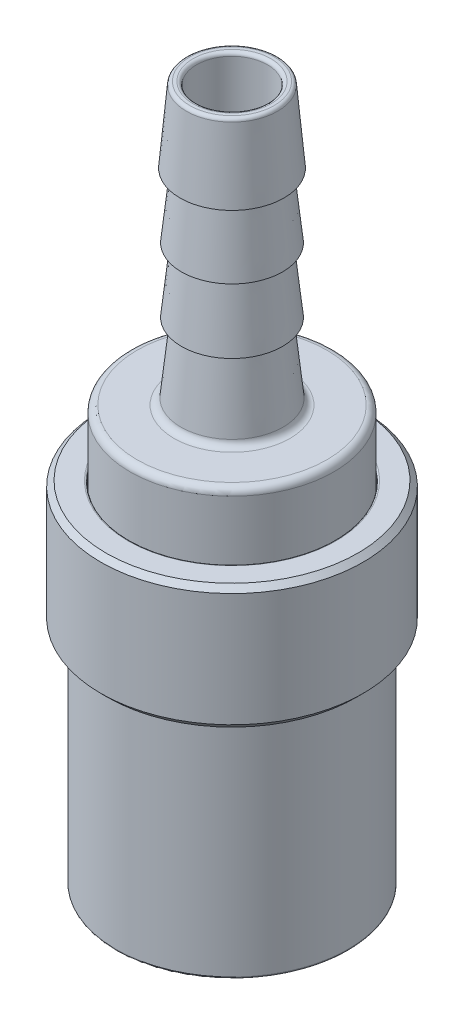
ISO-10303-21;
HEADER;
FILE_DESCRIPTION(('STEP AP214'),'2;1');
FILE_NAME('part.step','',(''),(''),'','','');
FILE_SCHEMA(('AUTOMOTIVE_DESIGN { 1 0 10303 214 1 1 1 1 }'));
ENDSEC;
DATA;
#1=APPLICATION_CONTEXT('core data for automotive mechanical design processes');
#2=APPLICATION_PROTOCOL_DEFINITION('international standard','automotive_design',2000,#1);
#3=PRODUCT_CONTEXT('',#1,'mechanical');
#4=PRODUCT('Part','Part','',(#3));
#5=PRODUCT_RELATED_PRODUCT_CATEGORY('part','',(#4));
#6=PRODUCT_DEFINITION_FORMATION('','',#4);
#7=PRODUCT_DEFINITION_CONTEXT('part definition',#1,'design');
#8=PRODUCT_DEFINITION('design','',#6,#7);
#9=PRODUCT_DEFINITION_SHAPE('','',#8);
#10=(LENGTH_UNIT() NAMED_UNIT(*) SI_UNIT(.MILLI.,.METRE.));
#11=(NAMED_UNIT(*) PLANE_ANGLE_UNIT() SI_UNIT($,.RADIAN.));
#12=(NAMED_UNIT(*) SI_UNIT($,.STERADIAN.) SOLID_ANGLE_UNIT());
#13=UNCERTAINTY_MEASURE_WITH_UNIT(LENGTH_MEASURE(1.E-05),#10,'distance_accuracy_value','');
#14=(GEOMETRIC_REPRESENTATION_CONTEXT(3) GLOBAL_UNCERTAINTY_ASSIGNED_CONTEXT((#13)) GLOBAL_UNIT_ASSIGNED_CONTEXT((#10,
#11,#12)) REPRESENTATION_CONTEXT('',''));
#15=CARTESIAN_POINT('',(0.,0.,0.));
#16=DIRECTION('',(0.,0.,1.));
#17=DIRECTION('',(1.,0.,0.));
#18=AXIS2_PLACEMENT_3D('',#15,#16,#17);
#19=CARTESIAN_POINT('',(0.,50.2644440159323,0.));
#20=DIRECTION('',(0.,-1.,0.));
#21=DIRECTION('',(0.,0.,-1.));
#22=AXIS2_PLACEMENT_3D('',#19,#20,#21);
#23=TOROIDAL_SURFACE('',#22,2.83165313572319,0.254);
#24=CARTESIAN_POINT('',(0.,50.5184345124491,0.));
#25=DIRECTION('',(0.,1.,0.));
#26=DIRECTION('',(0.,0.,1.));
#27=AXIS2_PLACEMENT_3D('',#24,#25,#26);
#28=CIRCLE('',#27,2.83385033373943);
#29=CARTESIAN_POINT('',(0.,50.5184345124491,-2.83385033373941));
#30=VERTEX_POINT('',#29);
#31=CARTESIAN_POINT('',(0.,50.5184345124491,2.83385033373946));
#32=VERTEX_POINT('',#31);
#33=EDGE_CURVE('P0_E11',#30,#32,#28,.T.);
#34=ORIENTED_EDGE('',*,*,#33,.T.);
#35=CARTESIAN_POINT('',(0.,50.2644440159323,2.83165313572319));
#36=DIRECTION('',(-1.,0.,0.));
#37=DIRECTION('',(0.,0.,1.));
#38=AXIS2_PLACEMENT_3D('',#35,#36,#37);
#39=CIRCLE('',#38,0.254);
#40=CARTESIAN_POINT('',(0.,50.2644440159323,2.5776531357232));
#41=VERTEX_POINT('',#40);
#42=EDGE_CURVE('P0_E26',#32,#41,#39,.T.);
#43=ORIENTED_EDGE('',*,*,#42,.T.);
#44=CARTESIAN_POINT('',(0.,50.2644440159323,0.));
#45=DIRECTION('',(0.,-1.,0.));
#46=DIRECTION('',(0.,0.,1.));
#47=AXIS2_PLACEMENT_3D('',#44,#45,#46);
#48=CIRCLE('',#47,2.5776531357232);
#49=CARTESIAN_POINT('',(0.,50.2644440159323,-2.57765313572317));
#50=VERTEX_POINT('',#49);
#51=EDGE_CURVE('P0_E299',#41,#50,#48,.T.);
#52=ORIENTED_EDGE('',*,*,#51,.T.);
#53=CARTESIAN_POINT('',(0.,50.2644440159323,0.));
#54=DIRECTION('',(0.,-1.,0.));
#55=DIRECTION('',(0.,0.,1.));
#56=AXIS2_PLACEMENT_3D('',#53,#54,#55);
#57=CIRCLE('',#56,2.5776531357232);
#58=EDGE_CURVE('P0_E247',#50,#41,#57,.T.);
#59=ORIENTED_EDGE('',*,*,#58,.T.);
#60=ORIENTED_EDGE('',*,*,#42,.F.);
#61=CARTESIAN_POINT('',(0.,50.5184345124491,0.));
#62=DIRECTION('',(0.,1.,0.));
#63=DIRECTION('',(0.,0.,1.));
#64=AXIS2_PLACEMENT_3D('',#61,#62,#63);
#65=CIRCLE('',#64,2.83385033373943);
#66=EDGE_CURVE('P0_E35',#32,#30,#65,.T.);
#67=ORIENTED_EDGE('',*,*,#66,.T.);
#68=EDGE_LOOP('',(#34,#43,#52,#59,#60,#67));
#69=FACE_BOUND('',#68,.T.);
#70=ADVANCED_FACE('P0_F16',(#69),#23,.T.);
#71=CARTESIAN_POINT('',(0.,50.5175524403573,0.));
#72=DIRECTION('',(0.,-1.,0.));
#73=DIRECTION('',(0.,0.,-1.));
#74=AXIS2_PLACEMENT_3D('',#71,#72,#73);
#75=CONICAL_SURFACE('',#74,2.93581562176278,1.56214583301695);
#76=CARTESIAN_POINT('',(0.,50.516450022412,0.));
#77=DIRECTION('',(0.,-1.,0.));
#78=DIRECTION('',(0.,0.,1.));
#79=AXIS2_PLACEMENT_3D('',#76,#77,#78);
#80=CIRCLE('',#79,3.06325232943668);
#81=CARTESIAN_POINT('',(0.,50.516450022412,-3.06325232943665));
#82=VERTEX_POINT('',#81);
#83=CARTESIAN_POINT('',(0.,50.516450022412,3.06325232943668));
#84=VERTEX_POINT('',#83);
#85=EDGE_CURVE('P0_E320',#82,#84,#80,.T.);
#86=ORIENTED_EDGE('',*,*,#85,.F.);
#87=CARTESIAN_POINT('',(0.,50.516450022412,0.));
#88=DIRECTION('',(0.,-1.,0.));
#89=DIRECTION('',(0.,0.,1.));
#90=AXIS2_PLACEMENT_3D('',#87,#88,#89);
#91=CIRCLE('',#90,3.06325232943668);
#92=EDGE_CURVE('P0_E366',#84,#82,#91,.T.);
#93=ORIENTED_EDGE('',*,*,#92,.F.);
#94=DIRECTION('',(0.,0.00865038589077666,-0.999962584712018));
#95=VECTOR('',#94,1.);
#96=CARTESIAN_POINT('',(0.,50.5175524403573,2.93581562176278));
#97=LINE('',#96,#95);
#98=EDGE_CURVE('P0_E248',#84,#32,#97,.T.);
#99=ORIENTED_EDGE('',*,*,#98,.T.);
#100=ORIENTED_EDGE('',*,*,#33,.F.);
#101=ORIENTED_EDGE('',*,*,#66,.F.);
#102=ORIENTED_EDGE('',*,*,#98,.F.);
#103=EDGE_LOOP('',(#86,#93,#99,#100,#101,#102));
#104=FACE_BOUND('',#103,.T.);
#105=ADVANCED_FACE('P0_F419',(#104),#75,.T.);
#106=CARTESIAN_POINT('',(0.,38.7478401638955,0.));
#107=DIRECTION('',(0.,-1.,0.));
#108=DIRECTION('',(0.,0.,-1.));
#109=AXIS2_PLACEMENT_3D('',#106,#107,#108);
#110=CYLINDRICAL_SURFACE('',#109,2.5776531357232);
#111=CARTESIAN_POINT('',(0.,26.9750295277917,0.));
#112=DIRECTION('',(0.,-1.,0.));
#113=DIRECTION('',(1.,0.,0.));
#114=AXIS2_PLACEMENT_3D('',#111,#112,#113);
#115=CIRCLE('',#114,2.57765313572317);
#116=CARTESIAN_POINT('',(0.,26.9750295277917,-2.57765313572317));
#117=VERTEX_POINT('',#116);
#118=CARTESIAN_POINT('',(0.,26.9750295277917,2.5776531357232));
#119=VERTEX_POINT('',#118);
#120=EDGE_CURVE('P0_E131',#117,#119,#115,.T.);
#121=ORIENTED_EDGE('',*,*,#120,.T.);
#122=DIRECTION('',(0.,1.,0.));
#123=VECTOR('',#122,1.);
#124=CARTESIAN_POINT('',(0.,38.7478401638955,2.5776531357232));
#125=LINE('',#124,#123);
#126=EDGE_CURVE('P0_E138',#119,#41,#125,.T.);
#127=ORIENTED_EDGE('',*,*,#126,.T.);
#128=ORIENTED_EDGE('',*,*,#58,.F.);
#129=ORIENTED_EDGE('',*,*,#51,.F.);
#130=ORIENTED_EDGE('',*,*,#126,.F.);
#131=CARTESIAN_POINT('',(0.,26.9750295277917,0.));
#132=DIRECTION('',(0.,-1.,0.));
#133=DIRECTION('',(1.,0.,0.));
#134=AXIS2_PLACEMENT_3D('',#131,#132,#133);
#135=CIRCLE('',#134,2.57765313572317);
#136=EDGE_CURVE('P0_E291',#119,#117,#135,.T.);
#137=ORIENTED_EDGE('',*,*,#136,.T.);
#138=EDGE_LOOP('',(#121,#127,#128,#129,#130,#137));
#139=FACE_BOUND('',#138,.T.);
#140=ADVANCED_FACE('P0_F425',(#139),#110,.F.);
#141=CARTESIAN_POINT('',(0.,50.2624595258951,0.));
#142=DIRECTION('',(0.,-1.,0.));
#143=DIRECTION('',(0.,0.,-1.));
#144=AXIS2_PLACEMENT_3D('',#141,#142,#143);
#145=TOROIDAL_SURFACE('',#144,3.06105513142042,0.254);
#146=CARTESIAN_POINT('',(0.,50.2845977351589,0.));
#147=DIRECTION('',(0.,1.,0.));
#148=DIRECTION('',(0.,0.,1.));
#149=AXIS2_PLACEMENT_3D('',#146,#147,#148);
#150=CIRCLE('',#149,3.31408852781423);
#151=CARTESIAN_POINT('',(0.,50.2845977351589,-3.31408852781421));
#152=VERTEX_POINT('',#151);
#153=CARTESIAN_POINT('',(0.,50.2845977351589,3.31408852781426));
#154=VERTEX_POINT('',#153);
#155=EDGE_CURVE('P0_E293',#152,#154,#150,.T.);
#156=ORIENTED_EDGE('',*,*,#155,.T.);
#157=CARTESIAN_POINT('',(0.,50.2624595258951,3.06105513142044));
#158=DIRECTION('',(-1.,0.,0.));
#159=DIRECTION('',(0.,0.,1.));
#160=AXIS2_PLACEMENT_3D('',#157,#158,#159);
#161=CIRCLE('',#160,0.254);
#162=EDGE_CURVE('P0_E363',#154,#84,#161,.T.);
#163=ORIENTED_EDGE('',*,*,#162,.T.);
#164=ORIENTED_EDGE('',*,*,#92,.T.);
#165=ORIENTED_EDGE('',*,*,#85,.T.);
#166=ORIENTED_EDGE('',*,*,#162,.F.);
#167=CARTESIAN_POINT('',(0.,50.2845977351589,0.));
#168=DIRECTION('',(0.,1.,0.));
#169=DIRECTION('',(0.,0.,1.));
#170=AXIS2_PLACEMENT_3D('',#167,#168,#169);
#171=CIRCLE('',#170,3.31408852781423);
#172=EDGE_CURVE('P0_E317',#154,#152,#171,.T.);
#173=ORIENTED_EDGE('',*,*,#172,.T.);
#174=EDGE_LOOP('',(#156,#163,#164,#165,#166,#173));
#175=FACE_BOUND('',#174,.T.);
#176=ADVANCED_FACE('P0_F436',(#175),#145,.T.);
#177=CARTESIAN_POINT('',(0.,47.7841572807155,0.));
#178=DIRECTION('',(0.,-1.,0.));
#179=DIRECTION('',(0.,0.,-1.));
#180=AXIS2_PLACEMENT_3D('',#177,#178,#179);
#181=CONICAL_SURFACE('',#180,3.53285519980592,0.0872690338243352);
#182=CARTESIAN_POINT('',(0.,45.0538604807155,0.));
#183=DIRECTION('',(0.,-1.,0.));
#184=DIRECTION('',(1.,0.,0.));
#185=AXIS2_PLACEMENT_3D('',#182,#183,#184);
#186=CIRCLE('',#185,3.77173229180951);
#187=CARTESIAN_POINT('',(0.,45.0538604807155,-3.77173229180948));
#188=VERTEX_POINT('',#187);
#189=CARTESIAN_POINT('',(0.,45.0538604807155,3.77173229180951));
#190=VERTEX_POINT('',#189);
#191=EDGE_CURVE('P0_E167',#188,#190,#186,.T.);
#192=ORIENTED_EDGE('',*,*,#191,.F.);
#193=CARTESIAN_POINT('',(0.,45.0538604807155,0.));
#194=DIRECTION('',(0.,-1.,0.));
#195=DIRECTION('',(1.,0.,0.));
#196=AXIS2_PLACEMENT_3D('',#193,#194,#195);
#197=CIRCLE('',#196,3.77173229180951);
#198=EDGE_CURVE('P0_E163',#190,#188,#197,.T.);
#199=ORIENTED_EDGE('',*,*,#198,.F.);
#200=DIRECTION('',(0.,0.996194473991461,-0.0871583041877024));
#201=VECTOR('',#200,1.);
#202=CARTESIAN_POINT('',(0.,47.7841572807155,3.53285519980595));
#203=LINE('',#202,#201);
#204=EDGE_CURVE('P0_E321',#190,#154,#203,.T.);
#205=ORIENTED_EDGE('',*,*,#204,.T.);
#206=ORIENTED_EDGE('',*,*,#155,.F.);
#207=ORIENTED_EDGE('',*,*,#172,.F.);
#208=ORIENTED_EDGE('',*,*,#204,.F.);
#209=EDGE_LOOP('',(#192,#199,#205,#206,#207,#208));
#210=FACE_BOUND('',#209,.T.);
#211=ADVANCED_FACE('P0_F439',(#210),#181,.T.);
#212=CARTESIAN_POINT('',(0.,30.6578,0.));
#213=DIRECTION('',(0.,-1.,0.));
#214=DIRECTION('',(0.,0.,-1.));
#215=AXIS2_PLACEMENT_3D('',#212,#213,#214);
#216=TOROIDAL_SURFACE('',#215,4.21145461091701,0.508);
#217=CARTESIAN_POINT('',(0.,30.6046219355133,0.));
#218=DIRECTION('',(0.,-1.,0.));
#219=DIRECTION('',(0.,0.,1.));
#220=AXIS2_PLACEMENT_3D('',#217,#218,#219);
#221=CIRCLE('',#220,3.70624565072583);
#222=CARTESIAN_POINT('',(0.,30.6046219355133,-3.70624565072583));
#223=VERTEX_POINT('',#222);
#224=CARTESIAN_POINT('',(0.,30.6046219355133,3.70624565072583));
#225=VERTEX_POINT('',#224);
#226=EDGE_CURVE('P0_E303',#223,#225,#221,.T.);
#227=ORIENTED_EDGE('',*,*,#226,.T.);
#228=CARTESIAN_POINT('',(0.,30.6578,4.21145461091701));
#229=DIRECTION('',(-1.,0.,0.));
#230=DIRECTION('',(0.,0.,1.));
#231=AXIS2_PLACEMENT_3D('',#228,#229,#230);
#232=CIRCLE('',#231,0.508);
#233=CARTESIAN_POINT('',(0.,30.1498,4.21145461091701));
#234=VERTEX_POINT('',#233);
#235=EDGE_CURVE('P0_E300',#225,#234,#232,.T.);
#236=ORIENTED_EDGE('',*,*,#235,.T.);
#237=CARTESIAN_POINT('',(0.,30.1498,0.));
#238=DIRECTION('',(0.,1.,0.));
#239=DIRECTION('',(0.,0.,1.));
#240=AXIS2_PLACEMENT_3D('',#237,#238,#239);
#241=CIRCLE('',#240,4.21145461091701);
#242=CARTESIAN_POINT('',(0.,30.1498,-4.21145461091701));
#243=VERTEX_POINT('',#242);
#244=EDGE_CURVE('P0_E304',#234,#243,#241,.T.);
#245=ORIENTED_EDGE('',*,*,#244,.T.);
#246=CARTESIAN_POINT('',(0.,30.1498,0.));
#247=DIRECTION('',(0.,1.,0.));
#248=DIRECTION('',(0.,0.,1.));
#249=AXIS2_PLACEMENT_3D('',#246,#247,#248);
#250=CIRCLE('',#249,4.21145461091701);
#251=EDGE_CURVE('P0_E284',#243,#234,#250,.T.);
#252=ORIENTED_EDGE('',*,*,#251,.T.);
#253=ORIENTED_EDGE('',*,*,#235,.F.);
#254=CARTESIAN_POINT('',(0.,30.6046219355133,0.));
#255=DIRECTION('',(0.,-1.,0.));
#256=DIRECTION('',(0.,0.,1.));
#257=AXIS2_PLACEMENT_3D('',#254,#255,#256);
#258=CIRCLE('',#257,3.70624565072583);
#259=EDGE_CURVE('P0_E281',#225,#223,#258,.T.);
#260=ORIENTED_EDGE('',*,*,#259,.T.);
#261=EDGE_LOOP('',(#227,#236,#245,#252,#253,#260));
#262=FACE_BOUND('',#261,.T.);
#263=ADVANCED_FACE('P0_F460',(#262),#216,.F.);
#264=CARTESIAN_POINT('',(0.,30.1498,-7.4041));
#265=DIRECTION('',(0.,1.,0.));
#266=DIRECTION('',(1.,0.,0.));
#267=AXIS2_PLACEMENT_3D('',#264,#265,#266);
#268=PLANE('',#267);
#269=CARTESIAN_POINT('',(0.,30.1498,0.));
#270=DIRECTION('',(0.,-1.,0.));
#271=DIRECTION('',(0.,0.,1.));
#272=AXIS2_PLACEMENT_3D('',#269,#270,#271);
#273=CIRCLE('',#272,6.8961);
#274=CARTESIAN_POINT('',(0.,30.1498,-6.8961));
#275=VERTEX_POINT('',#274);
#276=CARTESIAN_POINT('',(0.,30.1498,6.8961));
#277=VERTEX_POINT('',#276);
#278=EDGE_CURVE('P0_E249',#275,#277,#273,.T.);
#279=ORIENTED_EDGE('',*,*,#278,.F.);
#280=CARTESIAN_POINT('',(0.,30.1498,0.));
#281=DIRECTION('',(0.,-1.,0.));
#282=DIRECTION('',(0.,0.,1.));
#283=AXIS2_PLACEMENT_3D('',#280,#281,#282);
#284=CIRCLE('',#283,6.8961);
#285=EDGE_CURVE('P0_E251',#277,#275,#284,.T.);
#286=ORIENTED_EDGE('',*,*,#285,.F.);
#287=EDGE_LOOP('',(#279,#286));
#288=FACE_BOUND('',#287,.T.);
#289=ORIENTED_EDGE('',*,*,#251,.F.);
#290=ORIENTED_EDGE('',*,*,#244,.F.);
#291=EDGE_LOOP('',(#289,#290));
#292=FACE_BOUND('',#291,.T.);
#293=ADVANCED_FACE('P0_F471',(#288,#292),#268,.T.);
#294=CARTESIAN_POINT('',(0.,32.9028371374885,0.));
#295=DIRECTION('',(0.,-1.,0.));
#296=DIRECTION('',(0.,0.,-1.));
#297=AXIS2_PLACEMENT_3D('',#294,#295,#296);
#298=CONICAL_SURFACE('',#297,3.4643365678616,0.104873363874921);
#299=ORIENTED_EDGE('',*,*,#226,.F.);
#300=ORIENTED_EDGE('',*,*,#259,.F.);
#301=DIRECTION('',(0.,0.99450582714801,-0.104681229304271));
#302=VECTOR('',#301,1.);
#303=CARTESIAN_POINT('',(0.,32.9028371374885,3.4643365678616));
#304=LINE('',#303,#302);
#305=CARTESIAN_POINT('',(0.,35.6558742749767,3.17455313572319));
#306=VERTEX_POINT('',#305);
#307=EDGE_CURVE('P0_E285',#225,#306,#304,.T.);
#308=ORIENTED_EDGE('',*,*,#307,.T.);
#309=CARTESIAN_POINT('',(0.,35.6558742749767,0.));
#310=DIRECTION('',(0.,-1.,0.));
#311=DIRECTION('',(1.,0.,0.));
#312=AXIS2_PLACEMENT_3D('',#309,#310,#311);
#313=CIRCLE('',#312,3.17455313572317);
#314=CARTESIAN_POINT('',(0.,35.6558742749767,-3.17455313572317));
#315=VERTEX_POINT('',#314);
#316=EDGE_CURVE('P0_E346',#306,#315,#313,.T.);
#317=ORIENTED_EDGE('',*,*,#316,.T.);
#318=CARTESIAN_POINT('',(0.,35.6558742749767,0.));
#319=DIRECTION('',(0.,-1.,0.));
#320=DIRECTION('',(1.,0.,0.));
#321=AXIS2_PLACEMENT_3D('',#318,#319,#320);
#322=CIRCLE('',#321,3.17455313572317);
#323=EDGE_CURVE('P0_E270',#315,#306,#322,.T.);
#324=ORIENTED_EDGE('',*,*,#323,.T.);
#325=ORIENTED_EDGE('',*,*,#307,.F.);
#326=EDGE_LOOP('',(#299,#300,#308,#317,#324,#325));
#327=FACE_BOUND('',#326,.T.);
#328=ADVANCED_FACE('P0_F468',(#327),#298,.T.);
#329=CARTESIAN_POINT('',(0.,29.6418,0.));
#330=DIRECTION('',(0.,-1.,0.));
#331=DIRECTION('',(0.,0.,-1.));
#332=AXIS2_PLACEMENT_3D('',#329,#330,#331);
#333=TOROIDAL_SURFACE('',#332,6.8961,0.508);
#334=CARTESIAN_POINT('',(0.,29.6418,0.));
#335=DIRECTION('',(0.,1.,0.));
#336=DIRECTION('',(0.,0.,1.));
#337=AXIS2_PLACEMENT_3D('',#334,#335,#336);
#338=CIRCLE('',#337,7.4041);
#339=CARTESIAN_POINT('',(0.,29.6418,-7.4041));
#340=VERTEX_POINT('',#339);
#341=CARTESIAN_POINT('',(0.,29.6418,7.4041));
#342=VERTEX_POINT('',#341);
#343=EDGE_CURVE('P0_E374',#340,#342,#338,.T.);
#344=ORIENTED_EDGE('',*,*,#343,.T.);
#345=CARTESIAN_POINT('',(0.,29.6418,6.8961));
#346=DIRECTION('',(-1.,0.,0.));
#347=DIRECTION('',(0.,0.,1.));
#348=AXIS2_PLACEMENT_3D('',#345,#346,#347);
#349=CIRCLE('',#348,0.508);
#350=EDGE_CURVE('P0_E307',#342,#277,#349,.T.);
#351=ORIENTED_EDGE('',*,*,#350,.T.);
#352=ORIENTED_EDGE('',*,*,#285,.T.);
#353=ORIENTED_EDGE('',*,*,#278,.T.);
#354=ORIENTED_EDGE('',*,*,#350,.F.);
#355=CARTESIAN_POINT('',(0.,29.6418,0.));
#356=DIRECTION('',(0.,1.,0.));
#357=DIRECTION('',(0.,0.,1.));
#358=AXIS2_PLACEMENT_3D('',#355,#356,#357);
#359=CIRCLE('',#358,7.4041);
#360=EDGE_CURVE('P0_E252',#342,#340,#359,.T.);
#361=ORIENTED_EDGE('',*,*,#360,.T.);
#362=EDGE_LOOP('',(#344,#351,#352,#353,#354,#361));
#363=FACE_BOUND('',#362,.T.);
#364=ADVANCED_FACE('P0_F470',(#363),#333,.T.);
#365=CARTESIAN_POINT('',(0.,22.6949,0.));
#366=DIRECTION('',(0.,-1.,0.));
#367=DIRECTION('',(0.,0.,-1.));
#368=AXIS2_PLACEMENT_3D('',#365,#366,#367);
#369=CYLINDRICAL_SURFACE('',#368,7.4041);
#370=DIRECTION('',(0.,1.,0.));
#371=VECTOR('',#370,1.);
#372=CARTESIAN_POINT('',(0.,22.6949,7.4041));
#373=LINE('',#372,#371);
#374=CARTESIAN_POINT('',(0.,15.24,7.4041));
#375=VERTEX_POINT('',#374);
#376=CARTESIAN_POINT('',(0.,25.3999996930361,7.4041));
#377=VERTEX_POINT('',#376);
#378=EDGE_CURVE('P0_E253',#375,#377,#373,.T.);
#379=ORIENTED_EDGE('',*,*,#378,.T.);
#380=ORIENTED_EDGE('',*,*,#378,.F.);
#381=CARTESIAN_POINT('',(0.,15.24,0.));
#382=DIRECTION('',(0.,-1.,0.));
#383=DIRECTION('',(1.,0.,0.));
#384=AXIS2_PLACEMENT_3D('',#381,#382,#383);
#385=CIRCLE('',#384,7.4041);
#386=CARTESIAN_POINT('',(0.,15.24,-7.4041));
#387=VERTEX_POINT('',#386);
#388=EDGE_CURVE('P0_E347',#387,#375,#385,.T.);
#389=ORIENTED_EDGE('',*,*,#388,.F.);
#390=CARTESIAN_POINT('',(0.,15.24,0.));
#391=DIRECTION('',(0.,-1.,0.));
#392=DIRECTION('',(1.,0.,0.));
#393=AXIS2_PLACEMENT_3D('',#390,#391,#392);
#394=CIRCLE('',#393,7.4041);
#395=EDGE_CURVE('P0_E350',#375,#387,#394,.T.);
#396=ORIENTED_EDGE('',*,*,#395,.F.);
#397=EDGE_LOOP('',(#379,#380,#389,#396));
#398=FACE_BOUND('',#397,.T.);
#399=DIRECTION('',(0.,1.,0.));
#400=VECTOR('',#399,1.);
#401=CARTESIAN_POINT('',(0.,22.6949,7.4041));
#402=LINE('',#401,#400);
#403=CARTESIAN_POINT('',(0.,28.1939996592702,7.4041));
#404=VERTEX_POINT('',#403);
#405=EDGE_CURVE('P0_E254',#404,#342,#402,.T.);
#406=ORIENTED_EDGE('',*,*,#405,.F.);
#407=ORIENTED_EDGE('',*,*,#405,.T.);
#408=ORIENTED_EDGE('',*,*,#343,.F.);
#409=ORIENTED_EDGE('',*,*,#360,.F.);
#410=EDGE_LOOP('',(#406,#407,#408,#409));
#411=FACE_BOUND('',#410,.T.);
#412=ADVANCED_FACE('P0_F415',(#398,#411),#369,.T.);
#413=CARTESIAN_POINT('',(0.,0.3937,0.));
#414=DIRECTION('',(0.,-1.,0.));
#415=DIRECTION('',(0.,0.,1.));
#416=AXIS2_PLACEMENT_3D('',#413,#414,#415);
#417=CONICAL_SURFACE('',#416,5.1689,0.785398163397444);
#418=CARTESIAN_POINT('',(0.,0.7874,0.));
#419=DIRECTION('',(0.,1.,0.));
#420=DIRECTION('',(0.,0.,1.));
#421=AXIS2_PLACEMENT_3D('',#418,#419,#420);
#422=CIRCLE('',#421,4.7752);
#423=CARTESIAN_POINT('',(0.,0.7874,-4.7752));
#424=VERTEX_POINT('',#423);
#425=CARTESIAN_POINT('',(0.,0.7874,4.7752));
#426=VERTEX_POINT('',#425);
#427=EDGE_CURVE('P0_E260',#424,#426,#422,.T.);
#428=ORIENTED_EDGE('',*,*,#427,.T.);
#429=CARTESIAN_POINT('',(0.,0.7874,0.));
#430=DIRECTION('',(0.,1.,0.));
#431=DIRECTION('',(0.,0.,1.));
#432=AXIS2_PLACEMENT_3D('',#429,#430,#431);
#433=CIRCLE('',#432,4.7752);
#434=EDGE_CURVE('P0_E266',#426,#424,#433,.T.);
#435=ORIENTED_EDGE('',*,*,#434,.T.);
#436=DIRECTION('',(0.,-0.70710678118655,-0.707106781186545));
#437=VECTOR('',#436,1.);
#438=CARTESIAN_POINT('',(0.,0.3937,-5.1689));
#439=LINE('',#438,#437);
#440=CARTESIAN_POINT('',(0.,0.,-5.5626));
#441=VERTEX_POINT('',#440);
#442=EDGE_CURVE('P0_E322',#424,#441,#439,.T.);
#443=ORIENTED_EDGE('',*,*,#442,.T.);
#444=CARTESIAN_POINT('',(0.,0.,0.));
#445=DIRECTION('',(0.,-1.,0.));
#446=DIRECTION('',(0.,0.,1.));
#447=AXIS2_PLACEMENT_3D('',#444,#445,#446);
#448=CIRCLE('',#447,5.5626);
#449=EDGE_CURVE('P0_E325',#441,#441,#448,.T.);
#450=ORIENTED_EDGE('',*,*,#449,.T.);
#451=ORIENTED_EDGE('',*,*,#442,.F.);
#452=EDGE_LOOP('',(#428,#435,#443,#450,#451));
#453=FACE_BOUND('',#452,.T.);
#454=ADVANCED_FACE('P0_F400',(#453),#417,.F.);
#455=CARTESIAN_POINT('',(0.,0.,-4.7752));
#456=DIRECTION('',(0.,-1.,0.));
#457=DIRECTION('',(0.,0.,-1.));
#458=AXIS2_PLACEMENT_3D('',#455,#456,#457);
#459=PLANE('',#458);
#460=CARTESIAN_POINT('',(0.,0.,0.));
#461=DIRECTION('',(0.,-1.,0.));
#462=DIRECTION('',(1.,0.,0.));
#463=AXIS2_PLACEMENT_3D('',#460,#461,#462);
#464=CIRCLE('',#463,6.35);
#465=CARTESIAN_POINT('',(0.,0.,-6.35));
#466=VERTEX_POINT('',#465);
#467=CARTESIAN_POINT('',(0.,0.,6.35));
#468=VERTEX_POINT('',#467);
#469=EDGE_CURVE('P0_E244',#466,#468,#464,.T.);
#470=ORIENTED_EDGE('',*,*,#469,.T.);
#471=CARTESIAN_POINT('',(0.,0.,0.));
#472=DIRECTION('',(0.,-1.,0.));
#473=DIRECTION('',(1.,0.,0.));
#474=AXIS2_PLACEMENT_3D('',#471,#472,#473);
#475=CIRCLE('',#474,6.35);
#476=EDGE_CURVE('P0_E241',#468,#466,#475,.T.);
#477=ORIENTED_EDGE('',*,*,#476,.T.);
#478=EDGE_LOOP('',(#470,#477));
#479=FACE_BOUND('',#478,.T.);
#480=ORIENTED_EDGE('',*,*,#449,.F.);
#481=EDGE_LOOP('',(#480));
#482=FACE_BOUND('',#481,.T.);
#483=ADVANCED_FACE('P0_F402',(#479,#482),#459,.T.);
#484=CARTESIAN_POINT('',(0.,4.05954229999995,0.));
#485=DIRECTION('',(0.,-1.,0.));
#486=DIRECTION('',(0.,0.,-1.));
#487=AXIS2_PLACEMENT_3D('',#484,#485,#486);
#488=CYLINDRICAL_SURFACE('',#487,4.7752);
#489=ORIENTED_EDGE('',*,*,#427,.F.);
#490=ORIENTED_EDGE('',*,*,#434,.F.);
#491=DIRECTION('',(0.,1.,0.));
#492=VECTOR('',#491,1.);
#493=CARTESIAN_POINT('',(0.,4.05954229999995,4.7752));
#494=LINE('',#493,#492);
#495=CARTESIAN_POINT('',(0.,8.1190845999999,4.7752));
#496=VERTEX_POINT('',#495);
#497=EDGE_CURVE('P0_E245',#426,#496,#494,.T.);
#498=ORIENTED_EDGE('',*,*,#497,.T.);
#499=CARTESIAN_POINT('',(0.,8.11908459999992,0.));
#500=DIRECTION('',(0.,-1.,0.));
#501=DIRECTION('',(1.,0.,0.));
#502=AXIS2_PLACEMENT_3D('',#499,#500,#501);
#503=CIRCLE('',#502,4.7752);
#504=CARTESIAN_POINT('',(0.,8.11908459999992,-4.7752));
#505=VERTEX_POINT('',#504);
#506=EDGE_CURVE('P0_E272',#505,#496,#503,.T.);
#507=ORIENTED_EDGE('',*,*,#506,.F.);
#508=CARTESIAN_POINT('',(0.,8.11908459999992,0.));
#509=DIRECTION('',(0.,-1.,0.));
#510=DIRECTION('',(1.,0.,0.));
#511=AXIS2_PLACEMENT_3D('',#508,#509,#510);
#512=CIRCLE('',#511,4.7752);
#513=EDGE_CURVE('P0_E336',#496,#505,#512,.T.);
#514=ORIENTED_EDGE('',*,*,#513,.F.);
#515=ORIENTED_EDGE('',*,*,#497,.F.);
#516=EDGE_LOOP('',(#489,#490,#498,#507,#514,#515));
#517=FACE_BOUND('',#516,.T.);
#518=ADVANCED_FACE('P0_F404',(#517),#488,.F.);
#519=CARTESIAN_POINT('',(0.,12.8524,-3.3782));
#520=DIRECTION('',(0.,-1.,0.));
#521=DIRECTION('',(0.,0.,-1.));
#522=AXIS2_PLACEMENT_3D('',#519,#520,#521);
#523=PLANE('',#522);
#524=CARTESIAN_POINT('',(0.,12.8524,0.));
#525=DIRECTION('',(0.,-1.,0.));
#526=DIRECTION('',(1.,0.,0.));
#527=AXIS2_PLACEMENT_3D('',#524,#525,#526);
#528=CIRCLE('',#527,5.0546);
#529=CARTESIAN_POINT('',(0.,12.8524,-5.0546));
#530=VERTEX_POINT('',#529);
#531=CARTESIAN_POINT('',(0.,12.8524,5.0546));
#532=VERTEX_POINT('',#531);
#533=EDGE_CURVE('P0_E294',#530,#532,#528,.T.);
#534=ORIENTED_EDGE('',*,*,#533,.T.);
#535=CARTESIAN_POINT('',(0.,12.8524,0.));
#536=DIRECTION('',(0.,-1.,0.));
#537=DIRECTION('',(1.,0.,0.));
#538=AXIS2_PLACEMENT_3D('',#535,#536,#537);
#539=CIRCLE('',#538,5.0546);
#540=EDGE_CURVE('P0_E297',#532,#530,#539,.T.);
#541=ORIENTED_EDGE('',*,*,#540,.T.);
#542=EDGE_LOOP('',(#534,#541));
#543=FACE_BOUND('',#542,.T.);
#544=CARTESIAN_POINT('',(0.,12.8524,0.));
#545=DIRECTION('',(0.,-1.,0.));
#546=DIRECTION('',(1.,0.,0.));
#547=AXIS2_PLACEMENT_3D('',#544,#545,#546);
#548=CIRCLE('',#547,3.3782);
#549=CARTESIAN_POINT('',(0.,12.8524,-3.3782));
#550=VERTEX_POINT('',#549);
#551=CARTESIAN_POINT('',(0.,12.8524,3.3782));
#552=VERTEX_POINT('',#551);
#553=EDGE_CURVE('P0_E357',#550,#552,#548,.T.);
#554=ORIENTED_EDGE('',*,*,#553,.F.);
#555=CARTESIAN_POINT('',(0.,12.8524,0.));
#556=DIRECTION('',(0.,-1.,0.));
#557=DIRECTION('',(1.,0.,0.));
#558=AXIS2_PLACEMENT_3D('',#555,#556,#557);
#559=CIRCLE('',#558,3.3782);
#560=EDGE_CURVE('P0_E343',#552,#550,#559,.T.);
#561=ORIENTED_EDGE('',*,*,#560,.F.);
#562=EDGE_LOOP('',(#554,#561));
#563=FACE_BOUND('',#562,.T.);
#564=ADVANCED_FACE('P0_F412',(#543,#563),#523,.T.);
#565=CARTESIAN_POINT('',(0.,19.9137147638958,0.));
#566=DIRECTION('',(0.,-1.,0.));
#567=DIRECTION('',(0.,0.,-1.));
#568=AXIS2_PLACEMENT_3D('',#565,#566,#567);
#569=CYLINDRICAL_SURFACE('',#568,3.3782);
#570=ORIENTED_EDGE('',*,*,#553,.T.);
#571=DIRECTION('',(0.,1.,0.));
#572=VECTOR('',#571,1.);
#573=CARTESIAN_POINT('',(0.,19.9137147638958,3.3782));
#574=LINE('',#573,#572);
#575=CARTESIAN_POINT('',(0.,26.9750295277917,3.3782));
#576=VERTEX_POINT('',#575);
#577=EDGE_CURVE('P0_E485',#552,#576,#574,.T.);
#578=ORIENTED_EDGE('',*,*,#577,.T.);
#579=CARTESIAN_POINT('',(0.,26.9750295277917,0.));
#580=DIRECTION('',(0.,-1.,0.));
#581=DIRECTION('',(1.,0.,0.));
#582=AXIS2_PLACEMENT_3D('',#579,#580,#581);
#583=CIRCLE('',#582,3.3782);
#584=CARTESIAN_POINT('',(0.,26.9750295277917,-3.3782));
#585=VERTEX_POINT('',#584);
#586=EDGE_CURVE('P0_E341',#585,#576,#583,.T.);
#587=ORIENTED_EDGE('',*,*,#586,.F.);
#588=CARTESIAN_POINT('',(0.,26.9750295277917,0.));
#589=DIRECTION('',(0.,-1.,0.));
#590=DIRECTION('',(1.,0.,0.));
#591=AXIS2_PLACEMENT_3D('',#588,#589,#590);
#592=CIRCLE('',#591,3.3782);
#593=EDGE_CURVE('P0_E278',#576,#585,#592,.T.);
#594=ORIENTED_EDGE('',*,*,#593,.F.);
#595=ORIENTED_EDGE('',*,*,#577,.F.);
#596=ORIENTED_EDGE('',*,*,#560,.T.);
#597=EDGE_LOOP('',(#570,#578,#587,#594,#595,#596));
#598=FACE_BOUND('',#597,.T.);
#599=ADVANCED_FACE('P0_F429',(#598),#569,.F.);
#600=CARTESIAN_POINT('',(0.,26.9750295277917,-2.57765313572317));
#601=DIRECTION('',(0.,-1.,0.));
#602=DIRECTION('',(0.,0.,-1.));
#603=AXIS2_PLACEMENT_3D('',#600,#601,#602);
#604=PLANE('',#603);
#605=ORIENTED_EDGE('',*,*,#586,.T.);
#606=ORIENTED_EDGE('',*,*,#593,.T.);
#607=EDGE_LOOP('',(#605,#606));
#608=FACE_BOUND('',#607,.T.);
#609=ORIENTED_EDGE('',*,*,#120,.F.);
#610=ORIENTED_EDGE('',*,*,#136,.F.);
#611=EDGE_LOOP('',(#609,#610));
#612=FACE_BOUND('',#611,.T.);
#613=ADVANCED_FACE('P0_F431',(#608,#612),#604,.T.);
#614=CARTESIAN_POINT('',(0.,45.0538604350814,-3.17455289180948));
#615=DIRECTION('',(0.,-1.,0.));
#616=DIRECTION('',(0.,0.,-1.));
#617=AXIS2_PLACEMENT_3D('',#614,#615,#616);
#618=PLANE('',#617);
#619=ORIENTED_EDGE('',*,*,#191,.T.);
#620=ORIENTED_EDGE('',*,*,#198,.T.);
#621=EDGE_LOOP('',(#619,#620));
#622=FACE_BOUND('',#621,.T.);
#623=CARTESIAN_POINT('',(0.,45.0538604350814,0.));
#624=DIRECTION('',(0.,-1.,0.));
#625=DIRECTION('',(1.,0.,0.));
#626=AXIS2_PLACEMENT_3D('',#623,#624,#625);
#627=CIRCLE('',#626,3.17455289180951);
#628=CARTESIAN_POINT('',(0.,45.0538604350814,-3.17455289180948));
#629=VERTEX_POINT('',#628);
#630=CARTESIAN_POINT('',(0.,45.0538604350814,3.17455289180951));
#631=VERTEX_POINT('',#630);
#632=EDGE_CURVE('P0_E377',#629,#631,#627,.T.);
#633=ORIENTED_EDGE('',*,*,#632,.F.);
#634=CARTESIAN_POINT('',(0.,45.0538604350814,0.));
#635=DIRECTION('',(0.,-1.,0.));
#636=DIRECTION('',(1.,0.,0.));
#637=AXIS2_PLACEMENT_3D('',#634,#635,#636);
#638=CIRCLE('',#637,3.17455289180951);
#639=EDGE_CURVE('P0_E379',#631,#629,#638,.T.);
#640=ORIENTED_EDGE('',*,*,#639,.F.);
#641=EDGE_LOOP('',(#633,#640));
#642=FACE_BOUND('',#641,.T.);
#643=ADVANCED_FACE('P0_F434',(#622,#642),#618,.T.);
#644=CARTESIAN_POINT('',(0.,42.7043604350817,0.));
#645=DIRECTION('',(0.,-1.,0.));
#646=DIRECTION('',(0.,0.,-1.));
#647=AXIS2_PLACEMENT_3D('',#644,#645,#646);
#648=CONICAL_SURFACE('',#647,3.42186018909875,0.10487336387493);
#649=CARTESIAN_POINT('',(0.,40.3548604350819,0.));
#650=DIRECTION('',(0.,-1.,0.));
#651=DIRECTION('',(1.,0.,0.));
#652=AXIS2_PLACEMENT_3D('',#649,#650,#651);
#653=CIRCLE('',#652,3.66916748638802);
#654=CARTESIAN_POINT('',(0.,40.3548604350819,-3.66916748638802));
#655=VERTEX_POINT('',#654);
#656=CARTESIAN_POINT('',(0.,40.3548604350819,3.66916748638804));
#657=VERTEX_POINT('',#656);
#658=EDGE_CURVE('P0_E380',#655,#657,#653,.T.);
#659=ORIENTED_EDGE('',*,*,#658,.F.);
#660=CARTESIAN_POINT('',(0.,40.3548604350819,0.));
#661=DIRECTION('',(0.,-1.,0.));
#662=DIRECTION('',(1.,0.,0.));
#663=AXIS2_PLACEMENT_3D('',#660,#661,#662);
#664=CIRCLE('',#663,3.66916748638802);
#665=EDGE_CURVE('P0_E286',#657,#655,#664,.T.);
#666=ORIENTED_EDGE('',*,*,#665,.F.);
#667=DIRECTION('',(0.,0.994505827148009,-0.10468122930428));
#668=VECTOR('',#667,1.);
#669=CARTESIAN_POINT('',(0.,42.7043604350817,3.42186018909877));
#670=LINE('',#669,#668);
#671=EDGE_CURVE('P0_E240',#657,#631,#670,.T.);
#672=ORIENTED_EDGE('',*,*,#671,.T.);
#673=ORIENTED_EDGE('',*,*,#639,.T.);
#674=ORIENTED_EDGE('',*,*,#632,.T.);
#675=ORIENTED_EDGE('',*,*,#671,.F.);
#676=EDGE_LOOP('',(#659,#666,#672,#673,#674,#675));
#677=FACE_BOUND('',#676,.T.);
#678=ADVANCED_FACE('P0_F463',(#677),#648,.T.);
#679=CARTESIAN_POINT('',(0.,40.3592221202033,0.));
#680=DIRECTION('',(0.,-1.,0.));
#681=DIRECTION('',(0.,0.,-1.));
#682=AXIS2_PLACEMENT_3D('',#679,#680,#681);
#683=CONICAL_SURFACE('',#682,3.4218603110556,1.55316144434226);
#684=ORIENTED_EDGE('',*,*,#658,.T.);
#685=DIRECTION('',(0.,0.0176339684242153,-0.999844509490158));
#686=VECTOR('',#685,1.);
#687=CARTESIAN_POINT('',(0.,40.3592221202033,3.4218603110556));
#688=LINE('',#687,#686);
#689=CARTESIAN_POINT('',(0.,40.363583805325,3.17455313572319));
#690=VERTEX_POINT('',#689);
#691=EDGE_CURVE('P0_E288',#657,#690,#688,.T.);
#692=ORIENTED_EDGE('',*,*,#691,.T.);
#693=CARTESIAN_POINT('',(0.,40.363583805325,0.));
#694=DIRECTION('',(0.,-1.,0.));
#695=DIRECTION('',(1.,0.,0.));
#696=AXIS2_PLACEMENT_3D('',#693,#694,#695);
#697=CIRCLE('',#696,3.17455313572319);
#698=CARTESIAN_POINT('',(0.,40.363583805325,-3.17455313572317));
#699=VERTEX_POINT('',#698);
#700=EDGE_CURVE('P0_E371',#699,#690,#697,.T.);
#701=ORIENTED_EDGE('',*,*,#700,.F.);
#702=CARTESIAN_POINT('',(0.,40.363583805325,0.));
#703=DIRECTION('',(0.,-1.,0.));
#704=DIRECTION('',(1.,0.,0.));
#705=AXIS2_PLACEMENT_3D('',#702,#703,#704);
#706=CIRCLE('',#705,3.17455313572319);
#707=EDGE_CURVE('P0_E331',#690,#699,#706,.T.);
#708=ORIENTED_EDGE('',*,*,#707,.F.);
#709=ORIENTED_EDGE('',*,*,#691,.F.);
#710=ORIENTED_EDGE('',*,*,#665,.T.);
#711=EDGE_LOOP('',(#684,#692,#701,#708,#709,#710));
#712=FACE_BOUND('',#711,.T.);
#713=ADVANCED_FACE('P0_F445',(#712),#683,.F.);
#714=CARTESIAN_POINT('',(0.,38.0140838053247,0.));
#715=DIRECTION('',(0.,-1.,0.));
#716=DIRECTION('',(0.,0.,-1.));
#717=AXIS2_PLACEMENT_3D('',#714,#715,#716);
#718=CONICAL_SURFACE('',#717,3.42186043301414,0.104873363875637);
#719=CARTESIAN_POINT('',(0.,35.6645838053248,0.));
#720=DIRECTION('',(0.,-1.,0.));
#721=DIRECTION('',(1.,0.,0.));
#722=AXIS2_PLACEMENT_3D('',#719,#720,#721);
#723=CIRCLE('',#722,3.66916773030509);
#724=CARTESIAN_POINT('',(0.,35.664583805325,-3.66916773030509));
#725=VERTEX_POINT('',#724);
#726=CARTESIAN_POINT('',(0.,35.6645838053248,3.66916773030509));
#727=VERTEX_POINT('',#726);
#728=EDGE_CURVE('P0_E316',#725,#727,#723,.T.);
#729=ORIENTED_EDGE('',*,*,#728,.F.);
#730=CARTESIAN_POINT('',(0.,35.6645838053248,0.));
#731=DIRECTION('',(0.,-1.,0.));
#732=DIRECTION('',(1.,0.,0.));
#733=AXIS2_PLACEMENT_3D('',#730,#731,#732);
#734=CIRCLE('',#733,3.66916773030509);
#735=EDGE_CURVE('P0_E312',#727,#725,#734,.T.);
#736=ORIENTED_EDGE('',*,*,#735,.F.);
#737=DIRECTION('',(0.,0.994505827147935,-0.104681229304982));
#738=VECTOR('',#737,1.);
#739=CARTESIAN_POINT('',(0.,38.0140838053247,3.42186043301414));
#740=LINE('',#739,#738);
#741=EDGE_CURVE('P0_E289',#727,#690,#740,.T.);
#742=ORIENTED_EDGE('',*,*,#741,.T.);
#743=ORIENTED_EDGE('',*,*,#707,.T.);
#744=ORIENTED_EDGE('',*,*,#700,.T.);
#745=ORIENTED_EDGE('',*,*,#741,.F.);
#746=EDGE_LOOP('',(#729,#736,#742,#743,#744,#745));
#747=FACE_BOUND('',#746,.T.);
#748=ADVANCED_FACE('P0_F441',(#747),#718,.T.);
#749=CARTESIAN_POINT('',(0.,35.6602290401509,0.));
#750=DIRECTION('',(0.,1.,0.));
#751=DIRECTION('',(0.,0.,-1.));
#752=AXIS2_PLACEMENT_3D('',#749,#750,#751);
#753=CONICAL_SURFACE('',#752,3.42186043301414,1.55318942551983);
#754=ORIENTED_EDGE('',*,*,#323,.F.);
#755=ORIENTED_EDGE('',*,*,#316,.F.);
#756=DIRECTION('',(0.,0.0176059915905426,0.999845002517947));
#757=VECTOR('',#756,1.);
#758=CARTESIAN_POINT('',(0.,35.6602290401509,3.42186043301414));
#759=LINE('',#758,#757);
#760=EDGE_CURVE('P0_E315',#306,#727,#759,.T.);
#761=ORIENTED_EDGE('',*,*,#760,.T.);
#762=ORIENTED_EDGE('',*,*,#735,.T.);
#763=ORIENTED_EDGE('',*,*,#728,.T.);
#764=ORIENTED_EDGE('',*,*,#760,.F.);
#765=EDGE_LOOP('',(#754,#755,#761,#762,#763,#764));
#766=FACE_BOUND('',#765,.T.);
#767=ADVANCED_FACE('P0_F444',(#766),#753,.T.);
#768=CARTESIAN_POINT('',(0.,15.24,-6.35));
#769=DIRECTION('',(0.,-1.,0.));
#770=DIRECTION('',(0.,0.,-1.));
#771=AXIS2_PLACEMENT_3D('',#768,#769,#770);
#772=PLANE('',#771);
#773=ORIENTED_EDGE('',*,*,#388,.T.);
#774=ORIENTED_EDGE('',*,*,#395,.T.);
#775=EDGE_LOOP('',(#773,#774));
#776=FACE_BOUND('',#775,.T.);
#777=CARTESIAN_POINT('',(0.,15.24,0.));
#778=DIRECTION('',(0.,-1.,0.));
#779=DIRECTION('',(1.,0.,0.));
#780=AXIS2_PLACEMENT_3D('',#777,#778,#779);
#781=CIRCLE('',#780,6.35);
#782=CARTESIAN_POINT('',(0.,15.24,-6.35));
#783=VERTEX_POINT('',#782);
#784=CARTESIAN_POINT('',(0.,15.24,6.35));
#785=VERTEX_POINT('',#784);
#786=EDGE_CURVE('P0_E275',#783,#785,#781,.T.);
#787=ORIENTED_EDGE('',*,*,#786,.F.);
#788=CARTESIAN_POINT('',(0.,15.24,0.));
#789=DIRECTION('',(0.,-1.,0.));
#790=DIRECTION('',(1.,0.,0.));
#791=AXIS2_PLACEMENT_3D('',#788,#789,#790);
#792=CIRCLE('',#791,6.35);
#793=EDGE_CURVE('P0_E362',#785,#783,#792,.T.);
#794=ORIENTED_EDGE('',*,*,#793,.F.);
#795=EDGE_LOOP('',(#787,#794));
#796=FACE_BOUND('',#795,.T.);
#797=ADVANCED_FACE('P0_F454',(#776,#796),#772,.T.);
#798=CARTESIAN_POINT('',(0.,7.62,0.));
#799=DIRECTION('',(0.,-1.,0.));
#800=DIRECTION('',(0.,0.,-1.));
#801=AXIS2_PLACEMENT_3D('',#798,#799,#800);
#802=CYLINDRICAL_SURFACE('',#801,6.35);
#803=ORIENTED_EDGE('',*,*,#469,.F.);
#804=ORIENTED_EDGE('',*,*,#476,.F.);
#805=DIRECTION('',(0.,1.,0.));
#806=VECTOR('',#805,1.);
#807=CARTESIAN_POINT('',(0.,7.62,6.35));
#808=LINE('',#807,#806);
#809=EDGE_CURVE('P0_E359',#468,#785,#808,.T.);
#810=ORIENTED_EDGE('',*,*,#809,.T.);
#811=ORIENTED_EDGE('',*,*,#793,.T.);
#812=ORIENTED_EDGE('',*,*,#786,.T.);
#813=ORIENTED_EDGE('',*,*,#809,.F.);
#814=EDGE_LOOP('',(#803,#804,#810,#811,#812,#813));
#815=FACE_BOUND('',#814,.T.);
#816=ADVANCED_FACE('P0_F449',(#815),#802,.T.);
#817=CARTESIAN_POINT('',(0.,8.19974043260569,0.));
#818=DIRECTION('',(0.,1.,0.));
#819=DIRECTION('',(0.,0.,-1.));
#820=AXIS2_PLACEMENT_3D('',#817,#818,#819);
#821=CONICAL_SURFACE('',#820,4.9149,1.0471975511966);
#822=ORIENTED_EDGE('',*,*,#506,.T.);
#823=DIRECTION('',(0.,0.5,0.86602540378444));
#824=VECTOR('',#823,1.);
#825=CARTESIAN_POINT('',(0.,8.19974043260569,4.9149));
#826=LINE('',#825,#824);
#827=CARTESIAN_POINT('',(0.,8.28039626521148,5.0546));
#828=VERTEX_POINT('',#827);
#829=EDGE_CURVE('P0_E276',#496,#828,#826,.T.);
#830=ORIENTED_EDGE('',*,*,#829,.T.);
#831=CARTESIAN_POINT('',(0.,8.28039626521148,0.));
#832=DIRECTION('',(0.,-1.,0.));
#833=DIRECTION('',(1.,0.,0.));
#834=AXIS2_PLACEMENT_3D('',#831,#832,#833);
#835=CIRCLE('',#834,5.0546);
#836=CARTESIAN_POINT('',(0.,8.28039626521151,-5.0546));
#837=VERTEX_POINT('',#836);
#838=EDGE_CURVE('P0_E229',#837,#828,#835,.T.);
#839=ORIENTED_EDGE('',*,*,#838,.F.);
#840=CARTESIAN_POINT('',(0.,8.28039626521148,0.));
#841=DIRECTION('',(0.,-1.,0.));
#842=DIRECTION('',(1.,0.,0.));
#843=AXIS2_PLACEMENT_3D('',#840,#841,#842);
#844=CIRCLE('',#843,5.0546);
#845=EDGE_CURVE('P0_E20',#828,#837,#844,.T.);
#846=ORIENTED_EDGE('',*,*,#845,.F.);
#847=ORIENTED_EDGE('',*,*,#829,.F.);
#848=ORIENTED_EDGE('',*,*,#513,.T.);
#849=EDGE_LOOP('',(#822,#830,#839,#846,#847,#848));
#850=FACE_BOUND('',#849,.T.);
#851=ADVANCED_FACE('P0_F447',(#850),#821,.F.);
#852=CARTESIAN_POINT('',(0.,8.73912166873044,0.));
#853=DIRECTION('',(0.,-1.,0.));
#854=DIRECTION('',(0.,0.,-1.));
#855=AXIS2_PLACEMENT_3D('',#852,#853,#854);
#856=CYLINDRICAL_SURFACE('',#855,5.0546);
#857=ORIENTED_EDGE('',*,*,#838,.T.);
#858=DIRECTION('',(0.,1.,0.));
#859=VECTOR('',#858,1.);
#860=CARTESIAN_POINT('',(0.,8.73912166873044,5.0546));
#861=LINE('',#860,#859);
#862=CARTESIAN_POINT('',(0.,9.1978470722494,5.0546));
#863=VERTEX_POINT('',#862);
#864=EDGE_CURVE('P0_E219',#828,#863,#861,.T.);
#865=ORIENTED_EDGE('',*,*,#864,.T.);
#866=CARTESIAN_POINT('',(0.,9.1978470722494,0.));
#867=DIRECTION('',(0.,-1.,0.));
#868=DIRECTION('',(1.,0.,0.));
#869=AXIS2_PLACEMENT_3D('',#866,#867,#868);
#870=CIRCLE('',#869,5.0546);
#871=CARTESIAN_POINT('',(0.,9.19784707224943,-5.0546));
#872=VERTEX_POINT('',#871);
#873=EDGE_CURVE('P0_E220',#872,#863,#870,.T.);
#874=ORIENTED_EDGE('',*,*,#873,.F.);
#875=CARTESIAN_POINT('',(0.,9.1978470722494,0.));
#876=DIRECTION('',(0.,-1.,0.));
#877=DIRECTION('',(1.,0.,0.));
#878=AXIS2_PLACEMENT_3D('',#875,#876,#877);
#879=CIRCLE('',#878,5.0546);
#880=EDGE_CURVE('P0_E213',#863,#872,#879,.T.);
#881=ORIENTED_EDGE('',*,*,#880,.F.);
#882=ORIENTED_EDGE('',*,*,#864,.F.);
#883=ORIENTED_EDGE('',*,*,#845,.T.);
#884=EDGE_LOOP('',(#857,#865,#874,#881,#882,#883));
#885=FACE_BOUND('',#884,.T.);
#886=ADVANCED_FACE('P0_F216',(#885),#856,.F.);
#887=CARTESIAN_POINT('',(0.,9.35256261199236,0.));
#888=DIRECTION('',(0.,1.,0.));
#889=DIRECTION('',(0.,0.,-1.));
#890=AXIS2_PLACEMENT_3D('',#887,#888,#889);
#891=CONICAL_SURFACE('',#890,5.2578,0.920041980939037);
#892=ORIENTED_EDGE('',*,*,#873,.T.);
#893=DIRECTION('',(0.,0.605786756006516,0.795627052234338));
#894=VECTOR('',#893,1.);
#895=CARTESIAN_POINT('',(0.,9.35256261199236,5.2578));
#896=LINE('',#895,#894);
#897=CARTESIAN_POINT('',(0.,9.50727815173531,5.461));
#898=VERTEX_POINT('',#897);
#899=EDGE_CURVE('P0_E223',#863,#898,#896,.T.);
#900=ORIENTED_EDGE('',*,*,#899,.T.);
#901=CARTESIAN_POINT('',(0.,9.50727815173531,0.));
#902=DIRECTION('',(0.,-1.,0.));
#903=DIRECTION('',(1.,0.,0.));
#904=AXIS2_PLACEMENT_3D('',#901,#902,#903);
#905=CIRCLE('',#904,5.461);
#906=CARTESIAN_POINT('',(0.,9.50727815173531,-5.461));
#907=VERTEX_POINT('',#906);
#908=EDGE_CURVE('P0_E224',#907,#898,#905,.T.);
#909=ORIENTED_EDGE('',*,*,#908,.F.);
#910=CARTESIAN_POINT('',(0.,9.50727815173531,0.));
#911=DIRECTION('',(0.,-1.,0.));
#912=DIRECTION('',(1.,0.,0.));
#913=AXIS2_PLACEMENT_3D('',#910,#911,#912);
#914=CIRCLE('',#913,5.461);
#915=EDGE_CURVE('P0_E232',#898,#907,#914,.T.);
#916=ORIENTED_EDGE('',*,*,#915,.F.);
#917=ORIENTED_EDGE('',*,*,#899,.F.);
#918=ORIENTED_EDGE('',*,*,#880,.T.);
#919=EDGE_LOOP('',(#892,#900,#909,#916,#917,#918));
#920=FACE_BOUND('',#919,.T.);
#921=ADVANCED_FACE('P0_F18',(#920),#891,.F.);
#922=CARTESIAN_POINT('',(0.,10.4597781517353,0.));
#923=DIRECTION('',(0.,-1.,0.));
#924=DIRECTION('',(0.,0.,-1.));
#925=AXIS2_PLACEMENT_3D('',#922,#923,#924);
#926=CYLINDRICAL_SURFACE('',#925,5.461);
#927=ORIENTED_EDGE('',*,*,#908,.T.);
#928=DIRECTION('',(0.,1.,0.));
#929=VECTOR('',#928,1.);
#930=CARTESIAN_POINT('',(0.,10.4597781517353,5.461));
#931=LINE('',#930,#929);
#932=CARTESIAN_POINT('',(0.,11.4122781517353,5.461));
#933=VERTEX_POINT('',#932);
#934=EDGE_CURVE('P0_E280',#898,#933,#931,.T.);
#935=ORIENTED_EDGE('',*,*,#934,.T.);
#936=CARTESIAN_POINT('',(0.,11.4122781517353,0.));
#937=DIRECTION('',(0.,-1.,0.));
#938=DIRECTION('',(1.,0.,0.));
#939=AXIS2_PLACEMENT_3D('',#936,#937,#938);
#940=CIRCLE('',#939,5.461);
#941=CARTESIAN_POINT('',(0.,11.4122781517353,-5.461));
#942=VERTEX_POINT('',#941);
#943=EDGE_CURVE('P0_E354',#942,#933,#940,.T.);
#944=ORIENTED_EDGE('',*,*,#943,.F.);
#945=CARTESIAN_POINT('',(0.,11.4122781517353,0.));
#946=DIRECTION('',(0.,-1.,0.));
#947=DIRECTION('',(1.,0.,0.));
#948=AXIS2_PLACEMENT_3D('',#945,#946,#947);
#949=CIRCLE('',#948,5.461);
#950=EDGE_CURVE('P0_E355',#933,#942,#949,.T.);
#951=ORIENTED_EDGE('',*,*,#950,.F.);
#952=ORIENTED_EDGE('',*,*,#934,.F.);
#953=ORIENTED_EDGE('',*,*,#915,.T.);
#954=EDGE_LOOP('',(#927,#935,#944,#951,#952,#953));
#955=FACE_BOUND('',#954,.T.);
#956=ADVANCED_FACE('P0_F560',(#955),#926,.F.);
#957=CARTESIAN_POINT('',(0.,11.4973390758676,0.));
#958=DIRECTION('',(0.,-1.,0.));
#959=DIRECTION('',(0.,0.,-1.));
#960=AXIS2_PLACEMENT_3D('',#957,#958,#959);
#961=CONICAL_SURFACE('',#960,5.2578,1.17435312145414);
#962=ORIENTED_EDGE('',*,*,#943,.T.);
#963=DIRECTION('',(0.,0.386139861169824,-0.92244024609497));
#964=VECTOR('',#963,1.);
#965=CARTESIAN_POINT('',(0.,11.4973390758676,5.2578));
#966=LINE('',#965,#964);
#967=CARTESIAN_POINT('',(0.,11.5824,5.0546));
#968=VERTEX_POINT('',#967);
#969=EDGE_CURVE('P0_E351',#933,#968,#966,.T.);
#970=ORIENTED_EDGE('',*,*,#969,.T.);
#971=CARTESIAN_POINT('',(0.,11.5824,0.));
#972=DIRECTION('',(0.,-1.,0.));
#973=DIRECTION('',(1.,0.,0.));
#974=AXIS2_PLACEMENT_3D('',#971,#972,#973);
#975=CIRCLE('',#974,5.0546);
#976=CARTESIAN_POINT('',(0.,11.5824,-5.0546));
#977=VERTEX_POINT('',#976);
#978=EDGE_CURVE('P0_E237',#977,#968,#975,.T.);
#979=ORIENTED_EDGE('',*,*,#978,.F.);
#980=CARTESIAN_POINT('',(0.,11.5824,0.));
#981=DIRECTION('',(0.,-1.,0.));
#982=DIRECTION('',(1.,0.,0.));
#983=AXIS2_PLACEMENT_3D('',#980,#981,#982);
#984=CIRCLE('',#983,5.0546);
#985=EDGE_CURVE('P0_E385',#968,#977,#984,.T.);
#986=ORIENTED_EDGE('',*,*,#985,.F.);
#987=ORIENTED_EDGE('',*,*,#969,.F.);
#988=ORIENTED_EDGE('',*,*,#950,.T.);
#989=EDGE_LOOP('',(#962,#970,#979,#986,#987,#988));
#990=FACE_BOUND('',#989,.T.);
#991=ADVANCED_FACE('P0_F595',(#990),#961,.F.);
#992=CARTESIAN_POINT('',(0.,12.2174,0.));
#993=DIRECTION('',(0.,-1.,0.));
#994=DIRECTION('',(0.,0.,-1.));
#995=AXIS2_PLACEMENT_3D('',#992,#993,#994);
#996=CYLINDRICAL_SURFACE('',#995,5.0546);
#997=ORIENTED_EDGE('',*,*,#978,.T.);
#998=DIRECTION('',(0.,1.,0.));
#999=VECTOR('',#998,1.);
#1000=CARTESIAN_POINT('',(0.,12.2174,5.0546));
#1001=LINE('',#1000,#999);
#1002=EDGE_CURVE('P0_E388',#968,#532,#1001,.T.);
#1003=ORIENTED_EDGE('',*,*,#1002,.T.);
#1004=ORIENTED_EDGE('',*,*,#533,.F.);
#1005=ORIENTED_EDGE('',*,*,#540,.F.);
#1006=ORIENTED_EDGE('',*,*,#1002,.F.);
#1007=ORIENTED_EDGE('',*,*,#985,.T.);
#1008=EDGE_LOOP('',(#997,#1003,#1004,#1005,#1006,#1007));
#1009=FACE_BOUND('',#1008,.T.);
#1010=ADVANCED_FACE('P0_F603',(#1009),#996,.F.);
#1011=CLOSED_SHELL('',(#70,#105,#140,#176,#211,#263,#293,#328,#364,#412,#454,#483,#518,#564,
#599,#613,#643,#678,#713,#748,#767,#797,#816,#851,#886,#921,#956,#991,#1010));
#1012=MANIFOLD_SOLID_BREP('P0_B1',#1011);
#1013=CARTESIAN_POINT('',(0.,10.6299,0.));
#1014=DIRECTION('',(0.,-1.,0.));
#1015=DIRECTION('',(0.,0.,-1.));
#1016=AXIS2_PLACEMENT_3D('',#1013,#1014,#1015);
#1017=CYLINDRICAL_SURFACE('',#1016,3.5052);
#1018=CARTESIAN_POINT('',(0.,8.4074,0.));
#1019=DIRECTION('',(0.,-1.,0.));
#1020=DIRECTION('',(1.,0.,0.));
#1021=AXIS2_PLACEMENT_3D('',#1018,#1019,#1020);
#1022=CIRCLE('',#1021,3.5052);
#1023=CARTESIAN_POINT('',(0.,8.4074,-3.5052));
#1024=VERTEX_POINT('',#1023);
#1025=CARTESIAN_POINT('',(0.,8.4074,3.5052));
#1026=VERTEX_POINT('',#1025);
#1027=EDGE_CURVE('P1_E11',#1024,#1026,#1022,.T.);
#1028=ORIENTED_EDGE('',*,*,#1027,.T.);
#1029=DIRECTION('',(0.,1.,0.));
#1030=VECTOR('',#1029,1.);
#1031=CARTESIAN_POINT('',(0.,10.6299,3.5052));
#1032=LINE('',#1031,#1030);
#1033=CARTESIAN_POINT('',(0.,12.8524,3.5052));
#1034=VERTEX_POINT('',#1033);
#1035=EDGE_CURVE('P1_E26',#1026,#1034,#1032,.T.);
#1036=ORIENTED_EDGE('',*,*,#1035,.T.);
#1037=CARTESIAN_POINT('',(0.,12.8524,0.));
#1038=DIRECTION('',(0.,-1.,0.));
#1039=DIRECTION('',(1.,0.,0.));
#1040=AXIS2_PLACEMENT_3D('',#1037,#1038,#1039);
#1041=CIRCLE('',#1040,3.5052);
#1042=CARTESIAN_POINT('',(0.,12.8524,-3.5052));
#1043=VERTEX_POINT('',#1042);
#1044=EDGE_CURVE('P1_E49',#1043,#1034,#1041,.T.);
#1045=ORIENTED_EDGE('',*,*,#1044,.F.);
#1046=CARTESIAN_POINT('',(0.,12.8524,0.));
#1047=DIRECTION('',(0.,-1.,0.));
#1048=DIRECTION('',(1.,0.,0.));
#1049=AXIS2_PLACEMENT_3D('',#1046,#1047,#1048);
#1050=CIRCLE('',#1049,3.5052);
#1051=EDGE_CURVE('P1_E80',#1034,#1043,#1050,.T.);
#1052=ORIENTED_EDGE('',*,*,#1051,.F.);
#1053=ORIENTED_EDGE('',*,*,#1035,.F.);
#1054=CARTESIAN_POINT('',(0.,8.4074,0.));
#1055=DIRECTION('',(0.,-1.,0.));
#1056=DIRECTION('',(1.,0.,0.));
#1057=AXIS2_PLACEMENT_3D('',#1054,#1055,#1056);
#1058=CIRCLE('',#1057,3.5052);
#1059=EDGE_CURVE('P1_E73',#1026,#1024,#1058,.T.);
#1060=ORIENTED_EDGE('',*,*,#1059,.T.);
#1061=EDGE_LOOP('',(#1028,#1036,#1045,#1052,#1053,#1060));
#1062=FACE_BOUND('',#1061,.T.);
#1063=ADVANCED_FACE('P1_F16',(#1062),#1017,.F.);
#1064=CARTESIAN_POINT('',(0.,12.8524,-4.9022));
#1065=DIRECTION('',(0.,1.,0.));
#1066=DIRECTION('',(1.,0.,0.));
#1067=AXIS2_PLACEMENT_3D('',#1064,#1065,#1066);
#1068=PLANE('',#1067);
#1069=CARTESIAN_POINT('',(0.,12.8524,0.));
#1070=DIRECTION('',(0.,-1.,0.));
#1071=DIRECTION('',(1.,0.,0.));
#1072=AXIS2_PLACEMENT_3D('',#1069,#1070,#1071);
#1073=CIRCLE('',#1072,4.9022);
#1074=CARTESIAN_POINT('',(0.,12.8524,-4.9022));
#1075=VERTEX_POINT('',#1074);
#1076=CARTESIAN_POINT('',(0.,12.8524,4.9022));
#1077=VERTEX_POINT('',#1076);
#1078=EDGE_CURVE('P1_E88',#1075,#1077,#1073,.T.);
#1079=ORIENTED_EDGE('',*,*,#1078,.F.);
#1080=CARTESIAN_POINT('',(0.,12.8524,0.));
#1081=DIRECTION('',(0.,-1.,0.));
#1082=DIRECTION('',(1.,0.,0.));
#1083=AXIS2_PLACEMENT_3D('',#1080,#1081,#1082);
#1084=CIRCLE('',#1083,4.9022);
#1085=EDGE_CURVE('P1_E83',#1077,#1075,#1084,.T.);
#1086=ORIENTED_EDGE('',*,*,#1085,.F.);
#1087=EDGE_LOOP('',(#1079,#1086));
#1088=FACE_BOUND('',#1087,.T.);
#1089=ORIENTED_EDGE('',*,*,#1044,.T.);
#1090=ORIENTED_EDGE('',*,*,#1051,.T.);
#1091=EDGE_LOOP('',(#1089,#1090));
#1092=FACE_BOUND('',#1091,.T.);
#1093=ADVANCED_FACE('P1_F105',(#1088,#1092),#1068,.T.);
#1094=CARTESIAN_POINT('',(0.,10.6299,0.));
#1095=DIRECTION('',(0.,-1.,0.));
#1096=DIRECTION('',(0.,0.,-1.));
#1097=AXIS2_PLACEMENT_3D('',#1094,#1095,#1096);
#1098=CYLINDRICAL_SURFACE('',#1097,4.9022);
#1099=CARTESIAN_POINT('',(0.,8.4074,0.));
#1100=DIRECTION('',(0.,-1.,0.));
#1101=DIRECTION('',(1.,0.,0.));
#1102=AXIS2_PLACEMENT_3D('',#1099,#1100,#1101);
#1103=CIRCLE('',#1102,4.9022);
#1104=CARTESIAN_POINT('',(0.,8.4074,-4.9022));
#1105=VERTEX_POINT('',#1104);
#1106=CARTESIAN_POINT('',(0.,8.4074,4.9022));
#1107=VERTEX_POINT('',#1106);
#1108=EDGE_CURVE('P1_E89',#1105,#1107,#1103,.T.);
#1109=ORIENTED_EDGE('',*,*,#1108,.F.);
#1110=CARTESIAN_POINT('',(0.,8.4074,0.));
#1111=DIRECTION('',(0.,-1.,0.));
#1112=DIRECTION('',(1.,0.,0.));
#1113=AXIS2_PLACEMENT_3D('',#1110,#1111,#1112);
#1114=CIRCLE('',#1113,4.9022);
#1115=EDGE_CURVE('P1_E20',#1107,#1105,#1114,.T.);
#1116=ORIENTED_EDGE('',*,*,#1115,.F.);
#1117=DIRECTION('',(0.,1.,0.));
#1118=VECTOR('',#1117,1.);
#1119=CARTESIAN_POINT('',(0.,10.6299,4.9022));
#1120=LINE('',#1119,#1118);
#1121=EDGE_CURVE('P1_E87',#1107,#1077,#1120,.T.);
#1122=ORIENTED_EDGE('',*,*,#1121,.T.);
#1123=ORIENTED_EDGE('',*,*,#1085,.T.);
#1124=ORIENTED_EDGE('',*,*,#1078,.T.);
#1125=ORIENTED_EDGE('',*,*,#1121,.F.);
#1126=EDGE_LOOP('',(#1109,#1116,#1122,#1123,#1124,#1125));
#1127=FACE_BOUND('',#1126,.T.);
#1128=ADVANCED_FACE('P1_F18',(#1127),#1098,.T.);
#1129=CARTESIAN_POINT('',(0.,8.4074,-3.5052));
#1130=DIRECTION('',(0.,-1.,0.));
#1131=DIRECTION('',(0.,0.,-1.));
#1132=AXIS2_PLACEMENT_3D('',#1129,#1130,#1131);
#1133=PLANE('',#1132);
#1134=ORIENTED_EDGE('',*,*,#1108,.T.);
#1135=ORIENTED_EDGE('',*,*,#1115,.T.);
#1136=EDGE_LOOP('',(#1134,#1135));
#1137=FACE_BOUND('',#1136,.T.);
#1138=ORIENTED_EDGE('',*,*,#1027,.F.);
#1139=ORIENTED_EDGE('',*,*,#1059,.F.);
#1140=EDGE_LOOP('',(#1138,#1139));
#1141=FACE_BOUND('',#1140,.T.);
#1142=ADVANCED_FACE('P1_F72',(#1137,#1141),#1133,.T.);
#1143=CLOSED_SHELL('',(#1063,#1093,#1128,#1142));
#1144=MANIFOLD_SOLID_BREP('P1_B1',#1143);
#1145=CARTESIAN_POINT('',(0.,25.2095,0.));
#1146=DIRECTION('',(0.,-1.,0.));
#1147=DIRECTION('',(0.,0.,-1.));
#1148=AXIS2_PLACEMENT_3D('',#1145,#1146,#1147);
#1149=CONICAL_SURFACE('',#1148,9.3345,0.785398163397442);
#1150=CARTESIAN_POINT('',(0.,25.4,0.));
#1151=DIRECTION('',(0.,-1.,0.));
#1152=DIRECTION('',(0.,0.,-1.));
#1153=AXIS2_PLACEMENT_3D('',#1150,#1151,#1152);
#1154=CIRCLE('',#1153,9.144);
#1155=CARTESIAN_POINT('',(0.,25.4,9.144));
#1156=VERTEX_POINT('',#1155);
#1157=EDGE_CURVE('P2_E25',#1156,#1156,#1154,.T.);
#1158=ORIENTED_EDGE('',*,*,#1157,.T.);
#1159=DIRECTION('',(0.,-0.707106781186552,0.707106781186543));
#1160=VECTOR('',#1159,1.);
#1161=CARTESIAN_POINT('',(0.,25.2095,9.3345));
#1162=LINE('',#1161,#1160);
#1163=CARTESIAN_POINT('',(0.,25.019,9.525));
#1164=VERTEX_POINT('',#1163);
#1165=EDGE_CURVE('P2_E261',#1156,#1164,#1162,.T.);
#1166=ORIENTED_EDGE('',*,*,#1165,.T.);
#1167=CARTESIAN_POINT('',(0.,25.019,0.));
#1168=DIRECTION('',(0.,1.,0.));
#1169=DIRECTION('',(0.,0.,-1.));
#1170=AXIS2_PLACEMENT_3D('',#1167,#1168,#1169);
#1171=CIRCLE('',#1170,9.525);
#1172=CARTESIAN_POINT('',(0.,25.019,-9.525));
#1173=VERTEX_POINT('',#1172);
#1174=EDGE_CURVE('P2_E210',#1164,#1173,#1171,.T.);
#1175=ORIENTED_EDGE('',*,*,#1174,.T.);
#1176=CARTESIAN_POINT('',(0.,25.019,0.));
#1177=DIRECTION('',(0.,1.,0.));
#1178=DIRECTION('',(0.,0.,-1.));
#1179=AXIS2_PLACEMENT_3D('',#1176,#1177,#1178);
#1180=CIRCLE('',#1179,9.525);
#1181=EDGE_CURVE('P2_E207',#1173,#1164,#1180,.T.);
#1182=ORIENTED_EDGE('',*,*,#1181,.T.);
#1183=ORIENTED_EDGE('',*,*,#1165,.F.);
#1184=EDGE_LOOP('',(#1158,#1166,#1175,#1182,#1183));
#1185=FACE_BOUND('',#1184,.T.);
#1186=ADVANCED_FACE('P2_F16',(#1185),#1149,.T.);
#1187=CARTESIAN_POINT('',(0.,20.828,0.));
#1188=DIRECTION('',(0.,1.,0.));
#1189=DIRECTION('',(0.,0.,1.));
#1190=AXIS2_PLACEMENT_3D('',#1187,#1188,#1189);
#1191=CYLINDRICAL_SURFACE('',#1190,9.525);
#1192=ORIENTED_EDGE('',*,*,#1174,.F.);
#1193=ORIENTED_EDGE('',*,*,#1181,.F.);
#1194=DIRECTION('',(0.,-1.,0.));
#1195=VECTOR('',#1194,1.);
#1196=CARTESIAN_POINT('',(0.,20.828,-9.525));
#1197=LINE('',#1196,#1195);
#1198=CARTESIAN_POINT('',(0.,16.764,-9.525));
#1199=VERTEX_POINT('',#1198);
#1200=EDGE_CURVE('P2_E211',#1173,#1199,#1197,.T.);
#1201=ORIENTED_EDGE('',*,*,#1200,.T.);
#1202=CARTESIAN_POINT('',(0.,16.764,0.));
#1203=DIRECTION('',(0.,-1.,0.));
#1204=DIRECTION('',(0.,0.,-1.));
#1205=AXIS2_PLACEMENT_3D('',#1202,#1203,#1204);
#1206=CIRCLE('',#1205,9.525);
#1207=CARTESIAN_POINT('',(0.,16.764,9.525));
#1208=VERTEX_POINT('',#1207);
#1209=EDGE_CURVE('P2_E212',#1208,#1199,#1206,.T.);
#1210=ORIENTED_EDGE('',*,*,#1209,.F.);
#1211=CARTESIAN_POINT('',(0.,16.764,0.));
#1212=DIRECTION('',(0.,-1.,0.));
#1213=DIRECTION('',(0.,0.,-1.));
#1214=AXIS2_PLACEMENT_3D('',#1211,#1212,#1213);
#1215=CIRCLE('',#1214,9.525);
#1216=EDGE_CURVE('P2_E214',#1199,#1208,#1215,.T.);
#1217=ORIENTED_EDGE('',*,*,#1216,.F.);
#1218=ORIENTED_EDGE('',*,*,#1200,.F.);
#1219=EDGE_LOOP('',(#1192,#1193,#1201,#1210,#1217,#1218));
#1220=FACE_BOUND('',#1219,.T.);
#1221=ADVANCED_FACE('P2_F371',(#1220),#1191,.T.);
#1222=CARTESIAN_POINT('',(0.,25.4,7.4549));
#1223=DIRECTION('',(0.,1.,0.));
#1224=DIRECTION('',(1.,0.,0.));
#1225=AXIS2_PLACEMENT_3D('',#1222,#1223,#1224);
#1226=PLANE('',#1225);
#1227=ORIENTED_EDGE('',*,*,#1157,.F.);
#1228=EDGE_LOOP('',(#1227));
#1229=FACE_BOUND('',#1228,.T.);
#1230=CARTESIAN_POINT('',(0.,25.4,0.));
#1231=DIRECTION('',(0.,1.,0.));
#1232=DIRECTION('',(0.,0.,-1.));
#1233=AXIS2_PLACEMENT_3D('',#1230,#1231,#1232);
#1234=CIRCLE('',#1233,7.5819);
#1235=CARTESIAN_POINT('',(0.,25.4,-7.5819));
#1236=VERTEX_POINT('',#1235);
#1237=EDGE_CURVE('P2_E259',#1236,#1236,#1234,.T.);
#1238=ORIENTED_EDGE('',*,*,#1237,.F.);
#1239=EDGE_LOOP('',(#1238));
#1240=FACE_BOUND('',#1239,.T.);
#1241=ADVANCED_FACE('P2_F376',(#1229,#1240),#1226,.T.);
#1242=CARTESIAN_POINT('',(0.,6.096,0.));
#1243=DIRECTION('',(0.,1.,0.));
#1244=DIRECTION('',(0.,0.,1.));
#1245=AXIS2_PLACEMENT_3D('',#1242,#1243,#1244);
#1246=TOROIDAL_SURFACE('',#1245,6.6802,0.254);
#1247=CARTESIAN_POINT('',(0.,6.096,0.));
#1248=DIRECTION('',(0.,-1.,0.));
#1249=DIRECTION('',(0.,0.,-1.));
#1250=AXIS2_PLACEMENT_3D('',#1247,#1248,#1249);
#1251=CIRCLE('',#1250,6.4262);
#1252=CARTESIAN_POINT('',(0.,6.096,6.4262));
#1253=VERTEX_POINT('',#1252);
#1254=CARTESIAN_POINT('',(0.,6.096,-6.4262));
#1255=VERTEX_POINT('',#1254);
#1256=EDGE_CURVE('P2_E284',#1253,#1255,#1251,.T.);
#1257=ORIENTED_EDGE('',*,*,#1256,.T.);
#1258=CARTESIAN_POINT('',(0.,6.096,-6.6802));
#1259=DIRECTION('',(-1.,0.,0.));
#1260=DIRECTION('',(0.,0.,-1.));
#1261=AXIS2_PLACEMENT_3D('',#1258,#1259,#1260);
#1262=CIRCLE('',#1261,0.254);
#1263=CARTESIAN_POINT('',(0.,6.35,-6.6802));
#1264=VERTEX_POINT('',#1263);
#1265=EDGE_CURVE('P2_E225',#1255,#1264,#1262,.T.);
#1266=ORIENTED_EDGE('',*,*,#1265,.T.);
#1267=CARTESIAN_POINT('',(0.,6.35,0.));
#1268=DIRECTION('',(0.,1.,0.));
#1269=DIRECTION('',(0.,0.,-1.));
#1270=AXIS2_PLACEMENT_3D('',#1267,#1268,#1269);
#1271=CIRCLE('',#1270,6.6802);
#1272=CARTESIAN_POINT('',(0.,6.35,6.6802));
#1273=VERTEX_POINT('',#1272);
#1274=EDGE_CURVE('P2_E223',#1264,#1273,#1271,.T.);
#1275=ORIENTED_EDGE('',*,*,#1274,.T.);
#1276=CARTESIAN_POINT('',(0.,6.35,0.));
#1277=DIRECTION('',(0.,1.,0.));
#1278=DIRECTION('',(0.,0.,-1.));
#1279=AXIS2_PLACEMENT_3D('',#1276,#1277,#1278);
#1280=CIRCLE('',#1279,6.6802);
#1281=EDGE_CURVE('P2_E226',#1273,#1264,#1280,.T.);
#1282=ORIENTED_EDGE('',*,*,#1281,.T.);
#1283=ORIENTED_EDGE('',*,*,#1265,.F.);
#1284=CARTESIAN_POINT('',(0.,6.096,0.));
#1285=DIRECTION('',(0.,-1.,0.));
#1286=DIRECTION('',(0.,0.,-1.));
#1287=AXIS2_PLACEMENT_3D('',#1284,#1285,#1286);
#1288=CIRCLE('',#1287,6.4262);
#1289=EDGE_CURVE('P2_E292',#1255,#1253,#1288,.T.);
#1290=ORIENTED_EDGE('',*,*,#1289,.T.);
#1291=EDGE_LOOP('',(#1257,#1266,#1275,#1282,#1283,#1290));
#1292=FACE_BOUND('',#1291,.T.);
#1293=ADVANCED_FACE('P2_F334',(#1292),#1246,.T.);
#1294=CARTESIAN_POINT('',(0.,6.35,6.4262));
#1295=DIRECTION('',(0.,1.,0.));
#1296=DIRECTION('',(1.,0.,0.));
#1297=AXIS2_PLACEMENT_3D('',#1294,#1295,#1296);
#1298=PLANE('',#1297);
#1299=CARTESIAN_POINT('',(0.,6.35,0.));
#1300=DIRECTION('',(0.,-1.,0.));
#1301=DIRECTION('',(0.,0.,-1.));
#1302=AXIS2_PLACEMENT_3D('',#1299,#1300,#1301);
#1303=CIRCLE('',#1302,7.2009);
#1304=CARTESIAN_POINT('',(0.,6.35,7.2009));
#1305=VERTEX_POINT('',#1304);
#1306=CARTESIAN_POINT('',(0.,6.35,-7.2009));
#1307=VERTEX_POINT('',#1306);
#1308=EDGE_CURVE('P2_E205',#1305,#1307,#1303,.T.);
#1309=ORIENTED_EDGE('',*,*,#1308,.F.);
#1310=CARTESIAN_POINT('',(0.,6.35,0.));
#1311=DIRECTION('',(0.,-1.,0.));
#1312=DIRECTION('',(0.,0.,-1.));
#1313=AXIS2_PLACEMENT_3D('',#1310,#1311,#1312);
#1314=CIRCLE('',#1313,7.2009);
#1315=EDGE_CURVE('P2_E236',#1307,#1305,#1314,.T.);
#1316=ORIENTED_EDGE('',*,*,#1315,.F.);
#1317=EDGE_LOOP('',(#1309,#1316));
#1318=FACE_BOUND('',#1317,.T.);
#1319=ORIENTED_EDGE('',*,*,#1281,.F.);
#1320=ORIENTED_EDGE('',*,*,#1274,.F.);
#1321=EDGE_LOOP('',(#1319,#1320));
#1322=FACE_BOUND('',#1321,.T.);
#1323=ADVANCED_FACE('P2_F422',(#1318,#1322),#1298,.T.);
#1324=CARTESIAN_POINT('',(0.,4.1402,0.));
#1325=DIRECTION('',(0.,1.,0.));
#1326=DIRECTION('',(0.,0.,1.));
#1327=AXIS2_PLACEMENT_3D('',#1324,#1325,#1326);
#1328=CYLINDRICAL_SURFACE('',#1327,6.4262);
#1329=ORIENTED_EDGE('',*,*,#1256,.F.);
#1330=ORIENTED_EDGE('',*,*,#1289,.F.);
#1331=DIRECTION('',(0.,-1.,0.));
#1332=VECTOR('',#1331,1.);
#1333=CARTESIAN_POINT('',(0.,4.1402,-6.4262));
#1334=LINE('',#1333,#1332);
#1335=CARTESIAN_POINT('',(0.,1.9304,-6.4262));
#1336=VERTEX_POINT('',#1335);
#1337=EDGE_CURVE('P2_E274',#1255,#1336,#1334,.T.);
#1338=ORIENTED_EDGE('',*,*,#1337,.T.);
#1339=CARTESIAN_POINT('',(0.,1.9304,0.));
#1340=DIRECTION('',(0.,1.,0.));
#1341=DIRECTION('',(1.,0.,0.));
#1342=AXIS2_PLACEMENT_3D('',#1339,#1340,#1341);
#1343=CIRCLE('',#1342,6.4262);
#1344=CARTESIAN_POINT('',(0.,1.9304,6.4262));
#1345=VERTEX_POINT('',#1344);
#1346=EDGE_CURVE('P2_E312',#1345,#1336,#1343,.T.);
#1347=ORIENTED_EDGE('',*,*,#1346,.F.);
#1348=CARTESIAN_POINT('',(0.,1.9304,0.));
#1349=DIRECTION('',(0.,1.,0.));
#1350=DIRECTION('',(1.,0.,0.));
#1351=AXIS2_PLACEMENT_3D('',#1348,#1349,#1350);
#1352=CIRCLE('',#1351,6.4262);
#1353=EDGE_CURVE('P2_E190',#1336,#1345,#1352,.T.);
#1354=ORIENTED_EDGE('',*,*,#1353,.F.);
#1355=ORIENTED_EDGE('',*,*,#1337,.F.);
#1356=EDGE_LOOP('',(#1329,#1330,#1338,#1347,#1354,#1355));
#1357=FACE_BOUND('',#1356,.T.);
#1358=ADVANCED_FACE('P2_F337',(#1357),#1328,.F.);
#1359=CARTESIAN_POINT('',(0.,6.604,0.));
#1360=DIRECTION('',(0.,1.,0.));
#1361=DIRECTION('',(0.,0.,1.));
#1362=AXIS2_PLACEMENT_3D('',#1359,#1360,#1361);
#1363=TOROIDAL_SURFACE('',#1362,7.2009,0.254);
#1364=CARTESIAN_POINT('',(0.,6.604,0.));
#1365=DIRECTION('',(0.,1.,0.));
#1366=DIRECTION('',(0.,0.,-1.));
#1367=AXIS2_PLACEMENT_3D('',#1364,#1365,#1366);
#1368=CIRCLE('',#1367,7.4549);
#1369=CARTESIAN_POINT('',(0.,6.604,7.4549));
#1370=VERTEX_POINT('',#1369);
#1371=CARTESIAN_POINT('',(0.,6.604,-7.4549));
#1372=VERTEX_POINT('',#1371);
#1373=EDGE_CURVE('P2_E235',#1370,#1372,#1368,.T.);
#1374=ORIENTED_EDGE('',*,*,#1373,.T.);
#1375=CARTESIAN_POINT('',(0.,6.604,-7.2009));
#1376=DIRECTION('',(-1.,0.,0.));
#1377=DIRECTION('',(0.,0.,-1.));
#1378=AXIS2_PLACEMENT_3D('',#1375,#1376,#1377);
#1379=CIRCLE('',#1378,0.254);
#1380=EDGE_CURVE('P2_E232',#1372,#1307,#1379,.T.);
#1381=ORIENTED_EDGE('',*,*,#1380,.T.);
#1382=ORIENTED_EDGE('',*,*,#1315,.T.);
#1383=ORIENTED_EDGE('',*,*,#1308,.T.);
#1384=ORIENTED_EDGE('',*,*,#1380,.F.);
#1385=CARTESIAN_POINT('',(0.,6.604,0.));
#1386=DIRECTION('',(0.,1.,0.));
#1387=DIRECTION('',(0.,0.,-1.));
#1388=AXIS2_PLACEMENT_3D('',#1385,#1386,#1387);
#1389=CIRCLE('',#1388,7.4549);
#1390=EDGE_CURVE('P2_E202',#1372,#1370,#1389,.T.);
#1391=ORIENTED_EDGE('',*,*,#1390,.T.);
#1392=EDGE_LOOP('',(#1374,#1381,#1382,#1383,#1384,#1391));
#1393=FACE_BOUND('',#1392,.T.);
#1394=ADVANCED_FACE('P2_F383',(#1393),#1363,.F.);
#1395=CARTESIAN_POINT('',(0.,15.875,0.));
#1396=DIRECTION('',(0.,1.,0.));
#1397=DIRECTION('',(0.,0.,1.));
#1398=AXIS2_PLACEMENT_3D('',#1395,#1396,#1397);
#1399=CYLINDRICAL_SURFACE('',#1398,7.4549);
#1400=CARTESIAN_POINT('',(0.,25.273,0.));
#1401=DIRECTION('',(0.,-1.,0.));
#1402=DIRECTION('',(0.,0.,-1.));
#1403=AXIS2_PLACEMENT_3D('',#1400,#1401,#1402);
#1404=CIRCLE('',#1403,7.4549);
#1405=CARTESIAN_POINT('',(0.,25.273,7.4549));
#1406=VERTEX_POINT('',#1405);
#1407=CARTESIAN_POINT('',(0.,25.273,-7.4549));
#1408=VERTEX_POINT('',#1407);
#1409=EDGE_CURVE('P2_E200',#1406,#1408,#1404,.T.);
#1410=ORIENTED_EDGE('',*,*,#1409,.F.);
#1411=CARTESIAN_POINT('',(0.,25.273,0.));
#1412=DIRECTION('',(0.,-1.,0.));
#1413=DIRECTION('',(0.,0.,-1.));
#1414=AXIS2_PLACEMENT_3D('',#1411,#1412,#1413);
#1415=CIRCLE('',#1414,7.4549);
#1416=EDGE_CURVE('P2_E230',#1408,#1406,#1415,.T.);
#1417=ORIENTED_EDGE('',*,*,#1416,.F.);
#1418=DIRECTION('',(0.,-1.,0.));
#1419=VECTOR('',#1418,1.);
#1420=CARTESIAN_POINT('',(0.,15.875,-7.4549));
#1421=LINE('',#1420,#1419);
#1422=EDGE_CURVE('P2_E206',#1408,#1372,#1421,.T.);
#1423=ORIENTED_EDGE('',*,*,#1422,.T.);
#1424=ORIENTED_EDGE('',*,*,#1373,.F.);
#1425=ORIENTED_EDGE('',*,*,#1390,.F.);
#1426=ORIENTED_EDGE('',*,*,#1422,.F.);
#1427=EDGE_LOOP('',(#1410,#1417,#1423,#1424,#1425,#1426));
#1428=FACE_BOUND('',#1427,.T.);
#1429=ADVANCED_FACE('P2_F386',(#1428),#1399,.F.);
#1430=CARTESIAN_POINT('',(0.,16.51,0.));
#1431=DIRECTION('',(0.,1.,0.));
#1432=DIRECTION('',(0.,0.,-1.));
#1433=AXIS2_PLACEMENT_3D('',#1430,#1431,#1432);
#1434=CONICAL_SURFACE('',#1433,9.271,0.785398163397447);
#1435=ORIENTED_EDGE('',*,*,#1209,.T.);
#1436=ORIENTED_EDGE('',*,*,#1216,.T.);
#1437=DIRECTION('',(0.,-0.707106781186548,-0.707106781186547));
#1438=VECTOR('',#1437,1.);
#1439=CARTESIAN_POINT('',(0.,16.51,9.271));
#1440=LINE('',#1439,#1438);
#1441=CARTESIAN_POINT('',(0.,16.256,9.017));
#1442=VERTEX_POINT('',#1441);
#1443=EDGE_CURVE('P2_E252',#1208,#1442,#1440,.T.);
#1444=ORIENTED_EDGE('',*,*,#1443,.T.);
#1445=CARTESIAN_POINT('',(0.,16.256,0.));
#1446=DIRECTION('',(0.,1.,0.));
#1447=DIRECTION('',(0.,0.,-1.));
#1448=AXIS2_PLACEMENT_3D('',#1445,#1446,#1447);
#1449=CIRCLE('',#1448,9.017);
#1450=EDGE_CURVE('P2_E240',#1442,#1442,#1449,.T.);
#1451=ORIENTED_EDGE('',*,*,#1450,.T.);
#1452=ORIENTED_EDGE('',*,*,#1443,.F.);
#1453=EDGE_LOOP('',(#1435,#1436,#1444,#1451,#1452));
#1454=FACE_BOUND('',#1453,.T.);
#1455=ADVANCED_FACE('P2_F391',(#1454),#1434,.T.);
#1456=CARTESIAN_POINT('',(0.,16.256,9.525));
#1457=DIRECTION('',(0.,-1.,0.));
#1458=DIRECTION('',(0.,0.,-1.));
#1459=AXIS2_PLACEMENT_3D('',#1456,#1457,#1458);
#1460=PLANE('',#1459);
#1461=ORIENTED_EDGE('',*,*,#1450,.F.);
#1462=EDGE_LOOP('',(#1461));
#1463=FACE_BOUND('',#1462,.T.);
#1464=CARTESIAN_POINT('',(0.,16.256,0.));
#1465=DIRECTION('',(0.,1.,0.));
#1466=DIRECTION('',(1.,0.,0.));
#1467=AXIS2_PLACEMENT_3D('',#1464,#1465,#1466);
#1468=CIRCLE('',#1467,8.4328);
#1469=CARTESIAN_POINT('',(0.,16.256,8.4328));
#1470=VERTEX_POINT('',#1469);
#1471=CARTESIAN_POINT('',(0.,16.256,-8.4328));
#1472=VERTEX_POINT('',#1471);
#1473=EDGE_CURVE('P2_E237',#1470,#1472,#1468,.T.);
#1474=ORIENTED_EDGE('',*,*,#1473,.T.);
#1475=CARTESIAN_POINT('',(0.,16.256,0.));
#1476=DIRECTION('',(0.,1.,0.));
#1477=DIRECTION('',(1.,0.,0.));
#1478=AXIS2_PLACEMENT_3D('',#1475,#1476,#1477);
#1479=CIRCLE('',#1478,8.4328);
#1480=EDGE_CURVE('P2_E241',#1472,#1470,#1479,.T.);
#1481=ORIENTED_EDGE('',*,*,#1480,.T.);
#1482=EDGE_LOOP('',(#1474,#1481));
#1483=FACE_BOUND('',#1482,.T.);
#1484=ADVANCED_FACE('P2_F394',(#1463,#1483),#1460,.T.);
#1485=CARTESIAN_POINT('',(0.,0.127,0.));
#1486=DIRECTION('',(0.,1.,0.));
#1487=DIRECTION('',(0.,0.,1.));
#1488=AXIS2_PLACEMENT_3D('',#1485,#1486,#1487);
#1489=TOROIDAL_SURFACE('',#1488,8.3058,0.127);
#1490=CARTESIAN_POINT('',(0.,0.127,0.));
#1491=DIRECTION('',(0.,-1.,0.));
#1492=DIRECTION('',(0.,0.,-1.));
#1493=AXIS2_PLACEMENT_3D('',#1490,#1491,#1492);
#1494=CIRCLE('',#1493,8.4328);
#1495=CARTESIAN_POINT('',(0.,0.127,8.4328));
#1496=VERTEX_POINT('',#1495);
#1497=CARTESIAN_POINT('',(0.,0.127,-8.4328));
#1498=VERTEX_POINT('',#1497);
#1499=EDGE_CURVE('P2_E275',#1496,#1498,#1494,.T.);
#1500=ORIENTED_EDGE('',*,*,#1499,.T.);
#1501=CARTESIAN_POINT('',(0.,0.127,-8.3058));
#1502=DIRECTION('',(-1.,0.,0.));
#1503=DIRECTION('',(0.,0.,-1.));
#1504=AXIS2_PLACEMENT_3D('',#1501,#1502,#1503);
#1505=CIRCLE('',#1504,0.127);
#1506=CARTESIAN_POINT('',(0.,0.,-8.3058));
#1507=VERTEX_POINT('',#1506);
#1508=EDGE_CURVE('P2_E278',#1498,#1507,#1505,.T.);
#1509=ORIENTED_EDGE('',*,*,#1508,.T.);
#1510=CARTESIAN_POINT('',(0.,0.,0.));
#1511=DIRECTION('',(0.,1.,0.));
#1512=DIRECTION('',(0.,0.,-1.));
#1513=AXIS2_PLACEMENT_3D('',#1510,#1511,#1512);
#1514=CIRCLE('',#1513,8.3058);
#1515=CARTESIAN_POINT('',(0.,0.,8.3058));
#1516=VERTEX_POINT('',#1515);
#1517=EDGE_CURVE('P2_E299',#1507,#1516,#1514,.T.);
#1518=ORIENTED_EDGE('',*,*,#1517,.T.);
#1519=CARTESIAN_POINT('',(0.,0.,0.));
#1520=DIRECTION('',(0.,1.,0.));
#1521=DIRECTION('',(0.,0.,-1.));
#1522=AXIS2_PLACEMENT_3D('',#1519,#1520,#1521);
#1523=CIRCLE('',#1522,8.3058);
#1524=EDGE_CURVE('P2_E281',#1516,#1507,#1523,.T.);
#1525=ORIENTED_EDGE('',*,*,#1524,.T.);
#1526=ORIENTED_EDGE('',*,*,#1508,.F.);
#1527=CARTESIAN_POINT('',(0.,0.127,0.));
#1528=DIRECTION('',(0.,-1.,0.));
#1529=DIRECTION('',(0.,0.,-1.));
#1530=AXIS2_PLACEMENT_3D('',#1527,#1528,#1529);
#1531=CIRCLE('',#1530,8.4328);
#1532=EDGE_CURVE('P2_E245',#1498,#1496,#1531,.T.);
#1533=ORIENTED_EDGE('',*,*,#1532,.T.);
#1534=EDGE_LOOP('',(#1500,#1509,#1518,#1525,#1526,#1533));
#1535=FACE_BOUND('',#1534,.T.);
#1536=ADVANCED_FACE('P2_F483',(#1535),#1489,.T.);
#1537=CARTESIAN_POINT('',(0.,0.,8.4328));
#1538=DIRECTION('',(0.,-1.,0.));
#1539=DIRECTION('',(0.,0.,-1.));
#1540=AXIS2_PLACEMENT_3D('',#1537,#1538,#1539);
#1541=PLANE('',#1540);
#1542=ORIENTED_EDGE('',*,*,#1524,.F.);
#1543=ORIENTED_EDGE('',*,*,#1517,.F.);
#1544=EDGE_LOOP('',(#1542,#1543));
#1545=FACE_BOUND('',#1544,.T.);
#1546=CARTESIAN_POINT('',(0.,0.,0.));
#1547=DIRECTION('',(0.,-1.,0.));
#1548=DIRECTION('',(0.,0.,-1.));
#1549=AXIS2_PLACEMENT_3D('',#1546,#1547,#1548);
#1550=CIRCLE('',#1549,7.4422);
#1551=CARTESIAN_POINT('',(0.,0.,7.4422));
#1552=VERTEX_POINT('',#1551);
#1553=CARTESIAN_POINT('',(0.,0.,-7.4422));
#1554=VERTEX_POINT('',#1553);
#1555=EDGE_CURVE('P2_E227',#1552,#1554,#1550,.T.);
#1556=ORIENTED_EDGE('',*,*,#1555,.F.);
#1557=CARTESIAN_POINT('',(0.,0.,0.));
#1558=DIRECTION('',(0.,-1.,0.));
#1559=DIRECTION('',(0.,0.,-1.));
#1560=AXIS2_PLACEMENT_3D('',#1557,#1558,#1559);
#1561=CIRCLE('',#1560,7.4422);
#1562=EDGE_CURVE('P2_E249',#1554,#1552,#1561,.T.);
#1563=ORIENTED_EDGE('',*,*,#1562,.F.);
#1564=EDGE_LOOP('',(#1556,#1563));
#1565=FACE_BOUND('',#1564,.T.);
#1566=ADVANCED_FACE('P2_F480',(#1545,#1565),#1541,.T.);
#1567=CARTESIAN_POINT('',(0.,8.128,0.));
#1568=DIRECTION('',(0.,1.,0.));
#1569=DIRECTION('',(0.,0.,1.));
#1570=AXIS2_PLACEMENT_3D('',#1567,#1568,#1569);
#1571=CYLINDRICAL_SURFACE('',#1570,8.4328);
#1572=ORIENTED_EDGE('',*,*,#1473,.F.);
#1573=ORIENTED_EDGE('',*,*,#1480,.F.);
#1574=DIRECTION('',(0.,-1.,0.));
#1575=VECTOR('',#1574,1.);
#1576=CARTESIAN_POINT('',(0.,8.128,-8.4328));
#1577=LINE('',#1576,#1575);
#1578=EDGE_CURVE('P2_E242',#1472,#1498,#1577,.T.);
#1579=ORIENTED_EDGE('',*,*,#1578,.T.);
#1580=ORIENTED_EDGE('',*,*,#1499,.F.);
#1581=ORIENTED_EDGE('',*,*,#1532,.F.);
#1582=ORIENTED_EDGE('',*,*,#1578,.F.);
#1583=EDGE_LOOP('',(#1572,#1573,#1579,#1580,#1581,#1582));
#1584=FACE_BOUND('',#1583,.T.);
#1585=ADVANCED_FACE('P2_F405',(#1584),#1571,.T.);
#1586=CARTESIAN_POINT('',(0.,25.273,0.));
#1587=DIRECTION('',(0.,1.,0.));
#1588=DIRECTION('',(0.,0.,1.));
#1589=AXIS2_PLACEMENT_3D('',#1586,#1587,#1588);
#1590=TOROIDAL_SURFACE('',#1589,7.5819,0.127);
#1591=ORIENTED_EDGE('',*,*,#1409,.T.);
#1592=CARTESIAN_POINT('',(0.,25.273,-7.5819));
#1593=DIRECTION('',(-1.,0.,0.));
#1594=DIRECTION('',(0.,0.,-1.));
#1595=AXIS2_PLACEMENT_3D('',#1592,#1593,#1594);
#1596=CIRCLE('',#1595,0.127);
#1597=EDGE_CURVE('P2_E313',#1408,#1236,#1596,.T.);
#1598=ORIENTED_EDGE('',*,*,#1597,.T.);
#1599=ORIENTED_EDGE('',*,*,#1237,.T.);
#1600=ORIENTED_EDGE('',*,*,#1597,.F.);
#1601=ORIENTED_EDGE('',*,*,#1416,.T.);
#1602=EDGE_LOOP('',(#1591,#1598,#1599,#1600,#1601));
#1603=FACE_BOUND('',#1602,.T.);
#1604=ADVANCED_FACE('P2_F366',(#1603),#1590,.T.);
#1605=CARTESIAN_POINT('',(0.,0.127,0.));
#1606=DIRECTION('',(0.,1.,0.));
#1607=DIRECTION('',(0.,0.,1.));
#1608=AXIS2_PLACEMENT_3D('',#1605,#1606,#1607);
#1609=TOROIDAL_SURFACE('',#1608,7.4422,0.127);
#1610=ORIENTED_EDGE('',*,*,#1555,.T.);
#1611=CARTESIAN_POINT('',(0.,0.127,-7.4422));
#1612=DIRECTION('',(-1.,0.,0.));
#1613=DIRECTION('',(0.,0.,-1.));
#1614=AXIS2_PLACEMENT_3D('',#1611,#1612,#1613);
#1615=CIRCLE('',#1614,0.127);
#1616=CARTESIAN_POINT('',(0.,0.127,-7.3152));
#1617=VERTEX_POINT('',#1616);
#1618=EDGE_CURVE('P2_E231',#1554,#1617,#1615,.T.);
#1619=ORIENTED_EDGE('',*,*,#1618,.T.);
#1620=CARTESIAN_POINT('',(0.,0.127,0.));
#1621=DIRECTION('',(0.,1.,0.));
#1622=DIRECTION('',(0.,0.,-1.));
#1623=AXIS2_PLACEMENT_3D('',#1620,#1621,#1622);
#1624=CIRCLE('',#1623,7.3152);
#1625=CARTESIAN_POINT('',(0.,0.127,7.3152));
#1626=VERTEX_POINT('',#1625);
#1627=EDGE_CURVE('P2_E248',#1617,#1626,#1624,.T.);
#1628=ORIENTED_EDGE('',*,*,#1627,.T.);
#1629=CARTESIAN_POINT('',(0.,0.127,0.));
#1630=DIRECTION('',(0.,1.,0.));
#1631=DIRECTION('',(0.,0.,-1.));
#1632=AXIS2_PLACEMENT_3D('',#1629,#1630,#1631);
#1633=CIRCLE('',#1632,7.3152);
#1634=EDGE_CURVE('P2_E246',#1626,#1617,#1633,.T.);
#1635=ORIENTED_EDGE('',*,*,#1634,.T.);
#1636=ORIENTED_EDGE('',*,*,#1618,.F.);
#1637=ORIENTED_EDGE('',*,*,#1562,.T.);
#1638=EDGE_LOOP('',(#1610,#1619,#1628,#1635,#1636,#1637));
#1639=FACE_BOUND('',#1638,.T.);
#1640=ADVANCED_FACE('P2_F353',(#1639),#1609,.T.);
#1641=CARTESIAN_POINT('',(0.,0.5207,0.));
#1642=DIRECTION('',(0.,1.,0.));
#1643=DIRECTION('',(0.,0.,1.));
#1644=AXIS2_PLACEMENT_3D('',#1641,#1642,#1643);
#1645=CYLINDRICAL_SURFACE('',#1644,7.3152);
#1646=CARTESIAN_POINT('',(0.,1.0414,0.));
#1647=DIRECTION('',(0.,1.,0.));
#1648=DIRECTION('',(1.,0.,0.));
#1649=AXIS2_PLACEMENT_3D('',#1646,#1647,#1648);
#1650=CIRCLE('',#1649,7.3152);
#1651=CARTESIAN_POINT('',(0.,1.0414,7.3152));
#1652=VERTEX_POINT('',#1651);
#1653=CARTESIAN_POINT('',(0.,1.0414,-7.3152));
#1654=VERTEX_POINT('',#1653);
#1655=EDGE_CURVE('P2_E255',#1652,#1654,#1650,.T.);
#1656=ORIENTED_EDGE('',*,*,#1655,.T.);
#1657=DIRECTION('',(0.,-1.,0.));
#1658=VECTOR('',#1657,1.);
#1659=CARTESIAN_POINT('',(0.,0.5207,-7.3152));
#1660=LINE('',#1659,#1658);
#1661=EDGE_CURVE('P2_E318',#1654,#1617,#1660,.T.);
#1662=ORIENTED_EDGE('',*,*,#1661,.T.);
#1663=ORIENTED_EDGE('',*,*,#1634,.F.);
#1664=ORIENTED_EDGE('',*,*,#1627,.F.);
#1665=ORIENTED_EDGE('',*,*,#1661,.F.);
#1666=CARTESIAN_POINT('',(0.,1.0414,0.));
#1667=DIRECTION('',(0.,1.,0.));
#1668=DIRECTION('',(1.,0.,0.));
#1669=AXIS2_PLACEMENT_3D('',#1666,#1667,#1668);
#1670=CIRCLE('',#1669,7.3152);
#1671=EDGE_CURVE('P2_E325',#1654,#1652,#1670,.T.);
#1672=ORIENTED_EDGE('',*,*,#1671,.T.);
#1673=EDGE_LOOP('',(#1656,#1662,#1663,#1664,#1665,#1672));
#1674=FACE_BOUND('',#1673,.T.);
#1675=ADVANCED_FACE('P2_F357',(#1674),#1645,.F.);
#1676=CARTESIAN_POINT('',(0.,1.4859,0.));
#1677=DIRECTION('',(0.,-1.,0.));
#1678=DIRECTION('',(0.,0.,1.));
#1679=AXIS2_PLACEMENT_3D('',#1676,#1677,#1678);
#1680=CONICAL_SURFACE('',#1679,6.8707,0.78539816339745);
#1681=ORIENTED_EDGE('',*,*,#1346,.T.);
#1682=DIRECTION('',(0.,-0.707106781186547,-0.707106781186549));
#1683=VECTOR('',#1682,1.);
#1684=CARTESIAN_POINT('',(0.,1.4859,-6.8707));
#1685=LINE('',#1684,#1683);
#1686=EDGE_CURVE('P2_E194',#1336,#1654,#1685,.T.);
#1687=ORIENTED_EDGE('',*,*,#1686,.T.);
#1688=ORIENTED_EDGE('',*,*,#1655,.F.);
#1689=ORIENTED_EDGE('',*,*,#1671,.F.);
#1690=ORIENTED_EDGE('',*,*,#1686,.F.);
#1691=ORIENTED_EDGE('',*,*,#1353,.T.);
#1692=EDGE_LOOP('',(#1681,#1687,#1688,#1689,#1690,#1691));
#1693=FACE_BOUND('',#1692,.T.);
#1694=ADVANCED_FACE('P2_F341',(#1693),#1680,.F.);
#1695=CLOSED_SHELL('',(#1186,#1221,#1241,#1293,#1323,#1358,#1394,#1429,#1455,#1484,#1536,#1566,
#1585,#1604,#1640,#1675,#1694));
#1696=CARTESIAN_POINT('',(-1.65350047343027,22.5446492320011,8.89));
#1697=DIRECTION('',(-0.866025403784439,0.5,0.));
#1698=DIRECTION('',(0.,0.,1.));
#1699=AXIS2_PLACEMENT_3D('',#1696,#1697,#1698);
#1700=PLANE('',#1699);
#1701=DIRECTION('',(0.,0.,-1.));
#1702=VECTOR('',#1701,1.);
#1703=CARTESIAN_POINT('',(-1.65350047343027,22.5446492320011,8.89));
#1704=LINE('',#1703,#1702);
#1705=CARTESIAN_POINT('',(-1.65350047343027,22.5446492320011,8.89));
#1706=VERTEX_POINT('',#1705);
#1707=CARTESIAN_POINT('',(-1.65350047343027,22.5446492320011,8.8821642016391));
#1708=VERTEX_POINT('',#1707);
#1709=EDGE_CURVE('P2_E309',#1706,#1708,#1704,.T.);
#1710=ORIENTED_EDGE('',*,*,#1709,.T.);
#1711=CARTESIAN_POINT('',(0.,25.4085960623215,0.));
#1712=DIRECTION('',(-0.866025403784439,0.5,0.));
#1713=DIRECTION('',(0.5,0.866025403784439,0.));
#1714=AXIS2_PLACEMENT_3D('',#1711,#1712,#1713);
#1715=ELLIPSE('',#1714,18.0695218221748,9.03476091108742);
#1716=CARTESIAN_POINT('',(-1.61083975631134,22.6185397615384,8.89));
#1717=VERTEX_POINT('',#1716);
#1718=EDGE_CURVE('P2_E448',#1708,#1717,#1715,.T.);
#1719=ORIENTED_EDGE('',*,*,#1718,.T.);
#1720=DIRECTION('',(-0.5,-0.866025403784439,0.));
#1721=VECTOR('',#1720,1.);
#1722=CARTESIAN_POINT('',(-0.113707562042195,25.2116487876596,8.89));
#1723=LINE('',#1722,#1721);
#1724=EDGE_CURVE('P2_E218',#1717,#1706,#1723,.T.);
#1725=ORIENTED_EDGE('',*,*,#1724,.T.);
#1726=EDGE_LOOP('',(#1710,#1719,#1725));
#1727=FACE_BOUND('',#1726,.T.);
#1728=ADVANCED_FACE('P2_F454',(#1727),#1700,.F.);
#1729=CARTESIAN_POINT('',(-1.53979291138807,22.4790001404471,8.89));
#1730=DIRECTION('',(0.,0.,-1.));
#1731=DIRECTION('',(-0.866025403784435,0.500000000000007,0.));
#1732=AXIS2_PLACEMENT_3D('',#1729,#1730,#1731);
#1733=CYLINDRICAL_SURFACE('',#1732,0.131298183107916);
#1734=CARTESIAN_POINT('',(-1.53979291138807,22.4790001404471,8.89));
#1735=DIRECTION('',(0.,0.,1.));
#1736=DIRECTION('',(-0.866025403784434,0.500000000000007,0.));
#1737=AXIS2_PLACEMENT_3D('',#1734,#1735,#1736);
#1738=CIRCLE('',#1737,0.131298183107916);
#1739=CARTESIAN_POINT('',(-1.61083975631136,22.3685847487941,8.89));
#1740=VERTEX_POINT('',#1739);
#1741=EDGE_CURVE('P2_E215',#1706,#1740,#1738,.T.);
#1742=ORIENTED_EDGE('',*,*,#1741,.T.);
#1743=CARTESIAN_POINT('',(-1.61083975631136,22.3685847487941,8.89));
#1744=CARTESIAN_POINT('',(-1.61702459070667,22.3725570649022,8.88887941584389));
#1745=CARTESIAN_POINT('',(-1.62287582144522,22.3770630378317,8.88781242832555));
#1746=CARTESIAN_POINT('',(-1.63375702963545,22.3870011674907,8.88581864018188));
#1747=CARTESIAN_POINT('',(-1.63878708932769,22.3924332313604,8.88489182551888));
#1748=CARTESIAN_POINT('',(-1.64787721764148,22.4040884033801,8.8832103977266));
#1749=CARTESIAN_POINT('',(-1.65193642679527,22.4103122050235,8.88245593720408));
#1750=CARTESIAN_POINT('',(-1.65895342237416,22.4233687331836,8.88114806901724));
#1751=CARTESIAN_POINT('',(-1.66191168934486,22.4302011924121,8.88059457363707));
#1752=CARTESIAN_POINT('',(-1.66660716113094,22.4441976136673,8.8797145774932));
#1753=CARTESIAN_POINT('',(-1.66835832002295,22.4513567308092,8.87938548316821));
#1754=CARTESIAN_POINT('',(-1.67064000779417,22.465875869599,8.87895647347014));
#1755=CARTESIAN_POINT('',(-1.6711702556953,22.473235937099,8.87885661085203));
#1756=CARTESIAN_POINT('',(-1.67099370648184,22.4878591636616,8.87888983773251));
#1757=CARTESIAN_POINT('',(-1.67030034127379,22.4951225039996,8.87902039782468));
#1758=CARTESIAN_POINT('',(-1.66772360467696,22.5094244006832,8.87950473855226));
#1759=CARTESIAN_POINT('',(-1.66584120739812,22.5164631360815,8.87985833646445));
#1760=CARTESIAN_POINT('',(-1.66206859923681,22.5269942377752,8.88056498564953));
#1761=CARTESIAN_POINT('',(-1.66057444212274,22.5306383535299,8.88084456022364));
#1762=CARTESIAN_POINT('',(-1.65727063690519,22.5377674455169,8.88146167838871));
#1763=CARTESIAN_POINT('',(-1.65546156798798,22.5412526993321,8.88179911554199));
#1764=CARTESIAN_POINT('',(-1.65350047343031,22.5446492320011,8.8821642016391));
#1765=B_SPLINE_CURVE_WITH_KNOTS('',3,(#1743,#1744,#1745,#1746,#1747,#1748,#1749,#1750,#1751,
#1752,#1753,#1754,#1755,#1756,#1757,#1758,#1759,#1760,#1761,#1762,#1763,#1764),.UNSPECIFIED.,
.F.,.F.,(4,2,2,2,2,2,2,2,2,2,4),(0.,0.0222805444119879,0.0445588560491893,0.0668568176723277,
0.0891450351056,0.111171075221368,0.133202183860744,0.15499295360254,0.176765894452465,
0.188596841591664,0.200406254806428),.UNSPECIFIED.);
#1766=EDGE_CURVE('P2_E440',#1740,#1708,#1765,.T.);
#1767=ORIENTED_EDGE('',*,*,#1766,.T.);
#1768=ORIENTED_EDGE('',*,*,#1709,.F.);
#1769=EDGE_LOOP('',(#1742,#1767,#1768));
#1770=FACE_BOUND('',#1769,.T.);
#1771=ADVANCED_FACE('P2_F450',(#1770),#1733,.F.);
#1772=CARTESIAN_POINT('',(-0.00214909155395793,23.8124999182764,8.89));
#1773=DIRECTION('',(0.,0.,1.));
#1774=DIRECTION('',(1.,0.,0.));
#1775=AXIS2_PLACEMENT_3D('',#1772,#1773,#1774);
#1776=PLANE('',#1775);
#1777=ORIENTED_EDGE('',*,*,#1724,.F.);
#1778=DIRECTION('',(0.,1.,0.));
#1779=VECTOR('',#1778,1.);
#1780=CARTESIAN_POINT('',(-1.61083975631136,18.7325,8.89));
#1781=LINE('',#1780,#1779);
#1782=EDGE_CURVE('P2_E40',#1717,#1740,#1781,.F.);
#1783=ORIENTED_EDGE('',*,*,#1782,.T.);
#1784=ORIENTED_EDGE('',*,*,#1741,.F.);
#1785=EDGE_LOOP('',(#1777,#1783,#1784));
#1786=FACE_BOUND('',#1785,.T.);
#1787=ADVANCED_FACE('P2_F453',(#1786),#1776,.F.);
#1788=CARTESIAN_POINT('',(0.,18.7325,0.));
#1789=DIRECTION('',(0.,1.,0.));
#1790=DIRECTION('',(0.,0.,1.));
#1791=AXIS2_PLACEMENT_3D('',#1788,#1789,#1790);
#1792=CYLINDRICAL_SURFACE('',#1791,9.03476091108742);
#1793=ORIENTED_EDGE('',*,*,#1782,.F.);
#1794=ORIENTED_EDGE('',*,*,#1718,.F.);
#1795=ORIENTED_EDGE('',*,*,#1766,.F.);
#1796=EDGE_LOOP('',(#1793,#1794,#1795));
#1797=FACE_BOUND('',#1796,.T.);
#1798=ADVANCED_FACE('P2_F421',(#1797),#1792,.T.);
#1799=CLOSED_SHELL('',(#1728,#1771,#1787,#1798));
#1800=CARTESIAN_POINT('',(1.65350047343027,22.5446492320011,-8.89));
#1801=DIRECTION('',(0.866025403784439,0.5,0.));
#1802=DIRECTION('',(0.,0.,-1.));
#1803=AXIS2_PLACEMENT_3D('',#1800,#1801,#1802);
#1804=PLANE('',#1803);
#1805=DIRECTION('',(0.,0.,1.));
#1806=VECTOR('',#1805,1.);
#1807=CARTESIAN_POINT('',(1.65350047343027,22.5446492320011,-8.89));
#1808=LINE('',#1807,#1806);
#1809=CARTESIAN_POINT('',(1.65350047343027,22.5446492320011,-8.89));
#1810=VERTEX_POINT('',#1809);
#1811=CARTESIAN_POINT('',(1.65350047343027,22.5446492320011,-8.88216420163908));
#1812=VERTEX_POINT('',#1811);
#1813=EDGE_CURVE('P2_E185',#1810,#1812,#1808,.T.);
#1814=ORIENTED_EDGE('',*,*,#1813,.T.);
#1815=CARTESIAN_POINT('',(0.,25.4085960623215,0.));
#1816=DIRECTION('',(0.866025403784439,0.5,0.));
#1817=DIRECTION('',(-0.5,0.866025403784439,0.));
#1818=AXIS2_PLACEMENT_3D('',#1815,#1816,#1817);
#1819=ELLIPSE('',#1818,18.0695218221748,9.03476091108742);
#1820=CARTESIAN_POINT('',(1.61083975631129,22.6185397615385,-8.89));
#1821=VERTEX_POINT('',#1820);
#1822=EDGE_CURVE('P2_E10',#1812,#1821,#1819,.T.);
#1823=ORIENTED_EDGE('',*,*,#1822,.T.);
#1824=DIRECTION('',(0.5,-0.866025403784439,0.));
#1825=VECTOR('',#1824,1.);
#1826=CARTESIAN_POINT('',(0.113707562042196,25.2116487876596,-8.89));
#1827=LINE('',#1826,#1825);
#1828=EDGE_CURVE('P2_E189',#1821,#1810,#1827,.T.);
#1829=ORIENTED_EDGE('',*,*,#1828,.T.);
#1830=EDGE_LOOP('',(#1814,#1823,#1829));
#1831=FACE_BOUND('',#1830,.T.);
#1832=ADVANCED_FACE('P2_F18',(#1831),#1804,.F.);
#1833=CARTESIAN_POINT('',(1.53979291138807,22.4790001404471,-8.89));
#1834=DIRECTION('',(0.,0.,1.));
#1835=DIRECTION('',(0.866025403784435,0.500000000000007,0.));
#1836=AXIS2_PLACEMENT_3D('',#1833,#1834,#1835);
#1837=CYLINDRICAL_SURFACE('',#1836,0.131298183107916);
#1838=CARTESIAN_POINT('',(1.53979291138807,22.4790001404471,-8.89));
#1839=DIRECTION('',(0.,0.,-1.));
#1840=DIRECTION('',(0.866025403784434,0.500000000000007,0.));
#1841=AXIS2_PLACEMENT_3D('',#1838,#1839,#1840);
#1842=CIRCLE('',#1841,0.131298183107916);
#1843=CARTESIAN_POINT('',(1.61083975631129,22.3685847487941,-8.89));
#1844=VERTEX_POINT('',#1843);
#1845=EDGE_CURVE('P2_E187',#1810,#1844,#1842,.T.);
#1846=ORIENTED_EDGE('',*,*,#1845,.T.);
#1847=CARTESIAN_POINT('',(1.61083975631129,22.3685847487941,-8.89));
#1848=CARTESIAN_POINT('',(1.61702459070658,22.3725570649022,-8.8888794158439));
#1849=CARTESIAN_POINT('',(1.62287582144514,22.3770630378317,-8.88781242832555));
#1850=CARTESIAN_POINT('',(1.63375702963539,22.3870011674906,-8.88581864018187));
#1851=CARTESIAN_POINT('',(1.63878708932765,22.3924332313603,-8.88489182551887));
#1852=CARTESIAN_POINT('',(1.64787721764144,22.40408840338,-8.88321039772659));
#1853=CARTESIAN_POINT('',(1.65193642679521,22.4103122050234,-8.88245593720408));
#1854=CARTESIAN_POINT('',(1.65895342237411,22.4233687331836,-8.88114806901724));
#1855=CARTESIAN_POINT('',(1.66191168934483,22.430201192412,-8.88059457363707));
#1856=CARTESIAN_POINT('',(1.66660716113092,22.4441976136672,-8.87971457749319));
#1857=CARTESIAN_POINT('',(1.66835832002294,22.4513567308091,-8.8793854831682));
#1858=CARTESIAN_POINT('',(1.67064000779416,22.465875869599,-8.87895647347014));
#1859=CARTESIAN_POINT('',(1.6711702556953,22.473235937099,-8.87885661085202));
#1860=CARTESIAN_POINT('',(1.67099370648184,22.4878591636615,-8.8788898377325));
#1861=CARTESIAN_POINT('',(1.6703003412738,22.4951225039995,-8.87902039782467));
#1862=CARTESIAN_POINT('',(1.66772360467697,22.5094244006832,-8.87950473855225));
#1863=CARTESIAN_POINT('',(1.66584120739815,22.5164631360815,-8.87985833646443));
#1864=CARTESIAN_POINT('',(1.66206859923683,22.5269942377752,-8.88056498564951));
#1865=CARTESIAN_POINT('',(1.66057444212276,22.5306383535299,-8.88084456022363));
#1866=CARTESIAN_POINT('',(1.65727063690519,22.5377674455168,-8.88146167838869));
#1867=CARTESIAN_POINT('',(1.65546156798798,22.5412526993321,-8.88179911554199));
#1868=CARTESIAN_POINT('',(1.65350047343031,22.5446492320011,-8.88216420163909));
#1869=B_SPLINE_CURVE_WITH_KNOTS('',3,(#1847,#1848,#1849,#1850,#1851,#1852,#1853,#1854,#1855,
#1856,#1857,#1858,#1859,#1860,#1861,#1862,#1863,#1864,#1865,#1866,#1867,#1868),.UNSPECIFIED.,
.F.,.F.,(4,2,2,2,2,2,2,2,2,2,4),(0.,0.0222805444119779,0.0445588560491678,0.0668568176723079,
0.0891450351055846,0.111171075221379,0.13320218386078,0.154992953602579,0.176765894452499,
0.188596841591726,0.200406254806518),.UNSPECIFIED.);
#1870=EDGE_CURVE('P2_E175',#1844,#1812,#1869,.T.);
#1871=ORIENTED_EDGE('',*,*,#1870,.T.);
#1872=ORIENTED_EDGE('',*,*,#1813,.F.);
#1873=EDGE_LOOP('',(#1846,#1871,#1872));
#1874=FACE_BOUND('',#1873,.T.);
#1875=ADVANCED_FACE('P2_F184',(#1874),#1837,.F.);
#1876=CARTESIAN_POINT('',(0.00214909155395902,23.8124999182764,-8.89));
#1877=DIRECTION('',(0.,0.,-1.));
#1878=DIRECTION('',(0.,-1.,0.));
#1879=AXIS2_PLACEMENT_3D('',#1876,#1877,#1878);
#1880=PLANE('',#1879);
#1881=ORIENTED_EDGE('',*,*,#1828,.F.);
#1882=DIRECTION('',(0.,1.,0.));
#1883=VECTOR('',#1882,1.);
#1884=CARTESIAN_POINT('',(1.61083975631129,18.7325,-8.89));
#1885=LINE('',#1884,#1883);
#1886=EDGE_CURVE('P2_E177',#1821,#1844,#1885,.F.);
#1887=ORIENTED_EDGE('',*,*,#1886,.T.);
#1888=ORIENTED_EDGE('',*,*,#1845,.F.);
#1889=EDGE_LOOP('',(#1881,#1887,#1888));
#1890=FACE_BOUND('',#1889,.T.);
#1891=ADVANCED_FACE('P2_F484',(#1890),#1880,.F.);
#1892=ORIENTED_EDGE('',*,*,#1886,.F.);
#1893=ORIENTED_EDGE('',*,*,#1822,.F.);
#1894=ORIENTED_EDGE('',*,*,#1870,.F.);
#1895=EDGE_LOOP('',(#1892,#1893,#1894));
#1896=FACE_BOUND('',#1895,.T.);
#1897=ADVANCED_FACE('P2_F174',(#1896),#1792,.T.);
#1898=CLOSED_SHELL('',(#1832,#1875,#1891,#1897));
#1899=CARTESIAN_POINT('',(1.53979291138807,22.4790001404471,8.89));
#1900=DIRECTION('',(0.,0.,1.));
#1901=DIRECTION('',(-0.866025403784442,-0.5,0.));
#1902=AXIS2_PLACEMENT_3D('',#1899,#1900,#1901);
#1903=CIRCLE('',#1902,0.126999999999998);
#1904=CARTESIAN_POINT('',(1.61083975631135,22.3737321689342,8.89));
#1905=VERTEX_POINT('',#1904);
#1906=CARTESIAN_POINT('',(1.6497781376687,22.5425001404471,8.89));
#1907=VERTEX_POINT('',#1906);
#1908=EDGE_CURVE('P2_E219',#1905,#1907,#1903,.T.);
#1909=ORIENTED_EDGE('',*,*,#1908,.F.);
#1910=DIRECTION('',(0.,1.,0.));
#1911=VECTOR('',#1910,1.);
#1912=CARTESIAN_POINT('',(1.61083975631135,18.7325,8.89));
#1913=LINE('',#1912,#1911);
#1914=CARTESIAN_POINT('',(1.61083975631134,22.6099433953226,8.89));
#1915=VERTEX_POINT('',#1914);
#1916=EDGE_CURVE('P2_E32',#1905,#1915,#1913,.T.);
#1917=ORIENTED_EDGE('',*,*,#1916,.T.);
#1918=DIRECTION('',(-0.5,0.866025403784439,0.));
#1919=VECTOR('',#1918,1.);
#1920=CARTESIAN_POINT('',(1.6497781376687,22.5425001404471,8.89));
#1921=LINE('',#1920,#1919);
#1922=EDGE_CURVE('P2_E285',#1907,#1915,#1921,.T.);
#1923=ORIENTED_EDGE('',*,*,#1922,.F.);
#1924=EDGE_LOOP('',(#1909,#1917,#1923));
#1925=FACE_BOUND('',#1924,.T.);
#1926=ADVANCED_FACE('P2_F504',(#1925),#1776,.F.);
#1927=CARTESIAN_POINT('',(0.126645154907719,25.1806438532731,8.89));
#1928=DIRECTION('',(0.866025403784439,0.5,0.));
#1929=DIRECTION('',(0.,0.,-1.));
#1930=AXIS2_PLACEMENT_3D('',#1927,#1928,#1929);
#1931=PLANE('',#1930);
#1932=ORIENTED_EDGE('',*,*,#1922,.T.);
#1933=CARTESIAN_POINT('',(0.,25.3999996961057,0.));
#1934=DIRECTION('',(0.866025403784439,0.5,0.));
#1935=DIRECTION('',(-0.5,0.866025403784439,0.));
#1936=AXIS2_PLACEMENT_3D('',#1933,#1934,#1935);
#1937=ELLIPSE('',#1936,18.0695218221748,9.03476091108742);
#1938=CARTESIAN_POINT('',(1.6497781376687,22.5425001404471,8.88285634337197));
#1939=VERTEX_POINT('',#1938);
#1940=EDGE_CURVE('P2_E416',#1915,#1939,#1937,.T.);
#1941=ORIENTED_EDGE('',*,*,#1940,.T.);
#1942=DIRECTION('',(0.,0.,-1.));
#1943=VECTOR('',#1942,1.);
#1944=CARTESIAN_POINT('',(1.6497781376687,22.5425001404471,8.89));
#1945=LINE('',#1944,#1943);
#1946=EDGE_CURVE('P2_E301',#1907,#1939,#1945,.T.);
#1947=ORIENTED_EDGE('',*,*,#1946,.F.);
#1948=EDGE_LOOP('',(#1932,#1941,#1947));
#1949=FACE_BOUND('',#1948,.T.);
#1950=ADVANCED_FACE('P2_F401',(#1949),#1931,.F.);
#1951=CARTESIAN_POINT('',(1.53979291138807,22.4790001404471,8.89));
#1952=DIRECTION('',(0.,0.,-1.));
#1953=DIRECTION('',(-0.866025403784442,-0.5,0.));
#1954=AXIS2_PLACEMENT_3D('',#1951,#1952,#1953);
#1955=CYLINDRICAL_SURFACE('',#1954,0.126999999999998);
#1956=ORIENTED_EDGE('',*,*,#1946,.T.);
#1957=CARTESIAN_POINT('',(1.6497781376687,22.5425001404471,8.88285634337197));
#1958=CARTESIAN_POINT('',(1.65329591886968,22.5364199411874,8.88220281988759));
#1959=CARTESIAN_POINT('',(1.65630226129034,22.5300350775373,8.8816424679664));
#1960=CARTESIAN_POINT('',(1.66122426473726,22.5168483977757,8.88072327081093));
#1961=CARTESIAN_POINT('',(1.66314054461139,22.5100468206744,8.88036431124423));
#1962=CARTESIAN_POINT('',(1.66581976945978,22.4962065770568,8.87986209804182));
#1963=CARTESIAN_POINT('',(1.66658185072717,22.4891677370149,8.8797190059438));
#1964=CARTESIAN_POINT('',(1.66692755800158,22.475062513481,8.87965412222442));
#1965=CARTESIAN_POINT('',(1.66651156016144,22.4679961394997,8.87973225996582));
#1966=CARTESIAN_POINT('',(1.664519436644,22.4540691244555,8.88010589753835));
#1967=CARTESIAN_POINT('',(1.66294879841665,22.4472076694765,8.88040036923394));
#1968=CARTESIAN_POINT('',(1.65870161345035,22.4338463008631,8.88119464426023));
#1969=CARTESIAN_POINT('',(1.65602471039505,22.4273465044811,8.88169451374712));
#1970=CARTESIAN_POINT('',(1.64963139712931,22.4148598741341,8.88288419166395));
#1971=CARTESIAN_POINT('',(1.64590997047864,22.4088757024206,8.88357491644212));
#1972=CARTESIAN_POINT('',(1.63754406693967,22.3976196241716,8.88512082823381));
#1973=CARTESIAN_POINT('',(1.63290031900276,22.392347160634,8.88597588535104));
#1974=CARTESIAN_POINT('',(1.62522755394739,22.3849608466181,8.88738135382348));
#1975=CARTESIAN_POINT('',(1.62248108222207,22.3825374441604,8.88788322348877));
#1976=CARTESIAN_POINT('',(1.61679858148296,22.3779435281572,8.88891868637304));
#1977=CARTESIAN_POINT('',(1.6138629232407,22.375772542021,8.88945221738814));
#1978=CARTESIAN_POINT('',(1.61083975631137,22.3737321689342,8.89));
#1979=B_SPLINE_CURVE_WITH_KNOTS('',3,(#1957,#1958,#1959,#1960,#1961,#1962,#1963,#1964,#1965,
#1966,#1967,#1968,#1969,#1970,#1971,#1972,#1973,#1974,#1975,#1976,#1977,#1978),.UNSPECIFIED.,
.F.,.F.,(4,2,2,2,2,2,2,2,2,2,4),(0.,0.0211385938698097,0.0422651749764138,0.063407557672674,
0.0845431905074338,0.105579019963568,0.126621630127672,0.147767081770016,0.168895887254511,
0.179974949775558,0.191032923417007),.UNSPECIFIED.);
#1980=EDGE_CURVE('P2_E408',#1939,#1905,#1979,.T.);
#1981=ORIENTED_EDGE('',*,*,#1980,.T.);
#1982=ORIENTED_EDGE('',*,*,#1908,.T.);
#1983=EDGE_LOOP('',(#1956,#1981,#1982));
#1984=FACE_BOUND('',#1983,.T.);
#1985=ADVANCED_FACE('P2_F396',(#1984),#1955,.F.);
#1986=ORIENTED_EDGE('',*,*,#1916,.F.);
#1987=ORIENTED_EDGE('',*,*,#1980,.F.);
#1988=ORIENTED_EDGE('',*,*,#1940,.F.);
#1989=EDGE_LOOP('',(#1986,#1987,#1988));
#1990=FACE_BOUND('',#1989,.T.);
#1991=ADVANCED_FACE('P2_F400',(#1990),#1792,.T.);
#1992=CLOSED_SHELL('',(#1926,#1950,#1985,#1991));
#1993=CARTESIAN_POINT('',(-1.53979291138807,22.4790001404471,-8.89));
#1994=DIRECTION('',(0.,0.,-1.));
#1995=DIRECTION('',(0.866025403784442,-0.5,0.));
#1996=AXIS2_PLACEMENT_3D('',#1993,#1994,#1995);
#1997=CIRCLE('',#1996,0.126999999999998);
#1998=CARTESIAN_POINT('',(-1.6108397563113,22.3737321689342,-8.89));
#1999=VERTEX_POINT('',#1998);
#2000=CARTESIAN_POINT('',(-1.6497781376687,22.5425001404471,-8.89));
#2001=VERTEX_POINT('',#2000);
#2002=EDGE_CURVE('P2_E220',#1999,#2001,#1997,.T.);
#2003=ORIENTED_EDGE('',*,*,#2002,.F.);
#2004=DIRECTION('',(0.,1.,0.));
#2005=VECTOR('',#2004,1.);
#2006=CARTESIAN_POINT('',(-1.6108397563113,18.7325,-8.89));
#2007=LINE('',#2006,#2005);
#2008=CARTESIAN_POINT('',(-1.61083975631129,22.6099433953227,-8.89));
#2009=VERTEX_POINT('',#2008);
#2010=EDGE_CURVE('P2_E690',#1999,#2009,#2007,.T.);
#2011=ORIENTED_EDGE('',*,*,#2010,.T.);
#2012=DIRECTION('',(0.5,0.866025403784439,0.));
#2013=VECTOR('',#2012,1.);
#2014=CARTESIAN_POINT('',(-1.6497781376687,22.5425001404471,-8.89));
#2015=LINE('',#2014,#2013);
#2016=EDGE_CURVE('P2_E222',#2001,#2009,#2015,.T.);
#2017=ORIENTED_EDGE('',*,*,#2016,.F.);
#2018=EDGE_LOOP('',(#2003,#2011,#2017));
#2019=FACE_BOUND('',#2018,.T.);
#2020=ADVANCED_FACE('P2_F488',(#2019),#1880,.F.);
#2021=CARTESIAN_POINT('',(-0.126645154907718,25.1806438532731,-8.89));
#2022=DIRECTION('',(-0.866025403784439,0.5,0.));
#2023=DIRECTION('',(0.,0.,1.));
#2024=AXIS2_PLACEMENT_3D('',#2021,#2022,#2023);
#2025=PLANE('',#2024);
#2026=ORIENTED_EDGE('',*,*,#2016,.T.);
#2027=CARTESIAN_POINT('',(0.,25.3999996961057,0.));
#2028=DIRECTION('',(-0.866025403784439,0.5,0.));
#2029=DIRECTION('',(0.5,0.866025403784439,0.));
#2030=AXIS2_PLACEMENT_3D('',#2027,#2028,#2029);
#2031=ELLIPSE('',#2030,18.0695218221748,9.03476091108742);
#2032=CARTESIAN_POINT('',(-1.6497781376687,22.5425001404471,-8.88285634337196));
#2033=VERTEX_POINT('',#2032);
#2034=EDGE_CURVE('P2_E693',#2009,#2033,#2031,.T.);
#2035=ORIENTED_EDGE('',*,*,#2034,.T.);
#2036=DIRECTION('',(0.,0.,1.));
#2037=VECTOR('',#2036,1.);
#2038=CARTESIAN_POINT('',(-1.6497781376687,22.5425001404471,-8.89));
#2039=LINE('',#2038,#2037);
#2040=EDGE_CURVE('P2_E191',#2001,#2033,#2039,.T.);
#2041=ORIENTED_EDGE('',*,*,#2040,.F.);
#2042=EDGE_LOOP('',(#2026,#2035,#2041));
#2043=FACE_BOUND('',#2042,.T.);
#2044=ADVANCED_FACE('P2_F381',(#2043),#2025,.F.);
#2045=CARTESIAN_POINT('',(-1.53979291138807,22.4790001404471,-8.89));
#2046=DIRECTION('',(0.,0.,1.));
#2047=DIRECTION('',(0.866025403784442,-0.5,0.));
#2048=AXIS2_PLACEMENT_3D('',#2045,#2046,#2047);
#2049=CYLINDRICAL_SURFACE('',#2048,0.126999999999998);
#2050=ORIENTED_EDGE('',*,*,#2040,.T.);
#2051=CARTESIAN_POINT('',(-1.6497781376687,22.5425001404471,-8.88285634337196));
#2052=CARTESIAN_POINT('',(-1.65329591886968,22.5364199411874,-8.88220281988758));
#2053=CARTESIAN_POINT('',(-1.65630226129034,22.5300350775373,-8.88164246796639));
#2054=CARTESIAN_POINT('',(-1.66122426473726,22.5168483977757,-8.88072327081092));
#2055=CARTESIAN_POINT('',(-1.66314054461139,22.5100468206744,-8.88036431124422));
#2056=CARTESIAN_POINT('',(-1.66581976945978,22.4962065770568,-8.87986209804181));
#2057=CARTESIAN_POINT('',(-1.66658185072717,22.4891677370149,-8.87971900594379));
#2058=CARTESIAN_POINT('',(-1.66692755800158,22.475062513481,-8.87965412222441));
#2059=CARTESIAN_POINT('',(-1.66651156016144,22.4679961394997,-8.87973225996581));
#2060=CARTESIAN_POINT('',(-1.664519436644,22.4540691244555,-8.88010589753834));
#2061=CARTESIAN_POINT('',(-1.66294879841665,22.4472076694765,-8.88040036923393));
#2062=CARTESIAN_POINT('',(-1.65870161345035,22.4338463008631,-8.88119464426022));
#2063=CARTESIAN_POINT('',(-1.65602471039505,22.4273465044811,-8.88169451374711));
#2064=CARTESIAN_POINT('',(-1.64963139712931,22.4148598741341,-8.88288419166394));
#2065=CARTESIAN_POINT('',(-1.64590997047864,22.4088757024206,-8.88357491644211));
#2066=CARTESIAN_POINT('',(-1.63754406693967,22.3976196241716,-8.8851208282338));
#2067=CARTESIAN_POINT('',(-1.63290031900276,22.392347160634,-8.88597588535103));
#2068=CARTESIAN_POINT('',(-1.62522755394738,22.3849608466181,-8.88738135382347));
#2069=CARTESIAN_POINT('',(-1.62248108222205,22.3825374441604,-8.88788322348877));
#2070=CARTESIAN_POINT('',(-1.61679858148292,22.3779435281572,-8.88891868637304));
#2071=CARTESIAN_POINT('',(-1.61386292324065,22.375772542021,-8.88945221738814));
#2072=CARTESIAN_POINT('',(-1.61083975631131,22.3737321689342,-8.89));
#2073=B_SPLINE_CURVE_WITH_KNOTS('',3,(#2051,#2052,#2053,#2054,#2055,#2056,#2057,#2058,#2059,
#2060,#2061,#2062,#2063,#2064,#2065,#2066,#2067,#2068,#2069,#2070,#2071,#2072),.UNSPECIFIED.,
.F.,.F.,(4,2,2,2,2,2,2,2,2,2,4),(0.,0.0211385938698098,0.0422651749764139,0.0634075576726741,
0.0845431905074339,0.105579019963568,0.126621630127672,0.147767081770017,0.168895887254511,
0.179974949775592,0.191032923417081),.UNSPECIFIED.);
#2074=EDGE_CURVE('P2_E434',#2033,#1999,#2073,.T.);
#2075=ORIENTED_EDGE('',*,*,#2074,.T.);
#2076=ORIENTED_EDGE('',*,*,#2002,.T.);
#2077=EDGE_LOOP('',(#2050,#2075,#2076));
#2078=FACE_BOUND('',#2077,.T.);
#2079=ADVANCED_FACE('P2_F666',(#2078),#2049,.F.);
#2080=ORIENTED_EDGE('',*,*,#2010,.F.);
#2081=ORIENTED_EDGE('',*,*,#2074,.F.);
#2082=ORIENTED_EDGE('',*,*,#2034,.F.);
#2083=EDGE_LOOP('',(#2080,#2081,#2082));
#2084=FACE_BOUND('',#2083,.T.);
#2085=ADVANCED_FACE('P2_F593',(#2084),#1792,.T.);
#2086=CLOSED_SHELL('',(#2020,#2044,#2079,#2085));
#2087=ORIENTED_CLOSED_SHELL('',*,#1799,.T.);
#2088=ORIENTED_CLOSED_SHELL('',*,#1898,.T.);
#2089=ORIENTED_CLOSED_SHELL('',*,#1992,.T.);
#2090=ORIENTED_CLOSED_SHELL('',*,#2086,.T.);
#2091=BREP_WITH_VOIDS('P2_B1',#1695,(#2087,#2088,#2089,#2090));
#2092=ADVANCED_BREP_SHAPE_REPRESENTATION('',(#18,#1012,#1144,#2091),#14);
#2093=SHAPE_DEFINITION_REPRESENTATION(#9,#2092);
ENDSEC;
END-ISO-10303-21;
